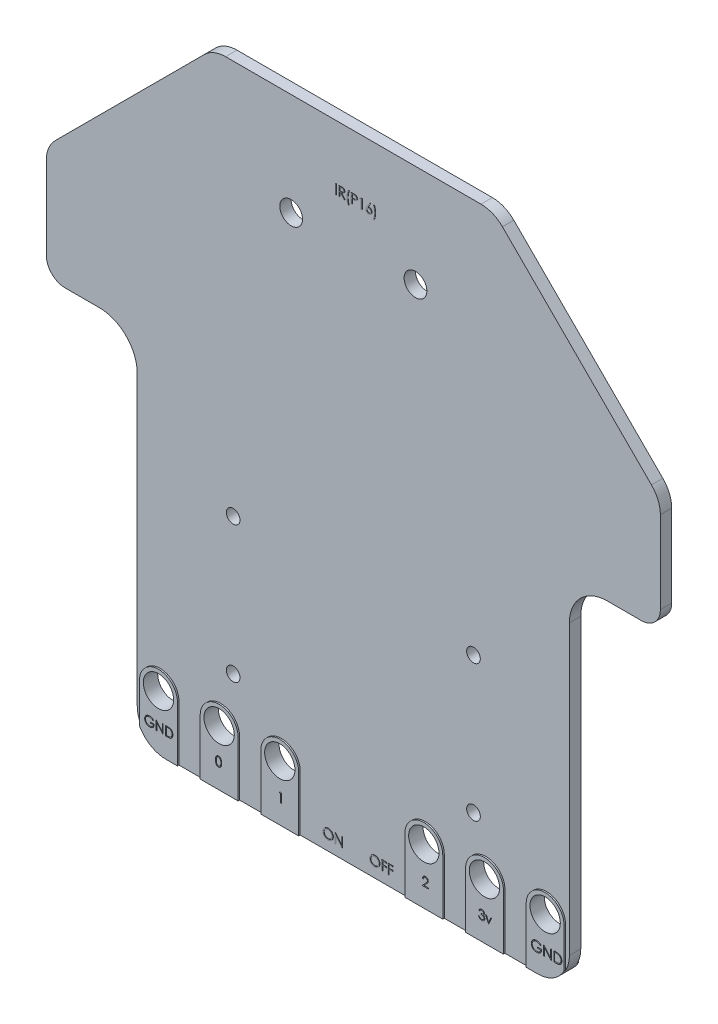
from build123d import *
from build123d.topology import SkipClean

# Parameters (mm, degrees)
ESQUISSE1_R             = 1.5
ESQUISSE1_R_2           = 0.9
ESQUISSE1_R_3           = 2
EXTRUSION1_DEPTH        = 1.5
ESQUISSE2_R             = 2
EXTRUSION2_DEPTH        = 0.2
ENL_V_MAT_EXTRU_1_DEPTH = 0.2
ESQUISSE4_W             = 0.112179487
ESQUISSE4_H             = 1.25
EXTRUSION3_DEPTH        = 0.05


with BuildPart() as part:
    # Esquisse1 → Extrusion1 (new body)
    with BuildSketch(Plane.XY):
        with BuildLine():
            Line((20.508625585, 0), (69.508625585, 0))
            ThreePointArc((69.508625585, 0), (72.337052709, 1.171572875), (73.508625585, 4))
            Line((73.508625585, 4), (73.508625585, 42))
            ThreePointArc((73.508625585, 42), (74.973091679, 45.535533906), (78.508625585, 47))
            Line((78.508625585, 47), (83.008625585, 47))
            ThreePointArc((83.008625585, 47), (84.776392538, 47.732233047), (85.508625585, 49.5))
            Line((85.508625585, 49.5), (85.508625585, 60.343145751))
            ThreePointArc((85.508625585, 60.343145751), (85.204143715, 61.87387948), (84.337052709, 63.171572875))
            Line((84.337052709, 63.171572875), (64.68019846, 82.828427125))
            ThreePointArc((64.68019846, 82.828427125), (63.382505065, 83.69551813), (61.851771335, 84))
            Line((61.851771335, 84), (28.165479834, 84))
            ThreePointArc((28.165479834, 84), (26.634746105, 83.69551813), (25.337052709, 82.828427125))
            Line((25.337052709, 82.828427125), (5.68019846, 63.171572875))
            ThreePointArc((5.68019846, 63.171572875), (4.813107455, 61.87387948), (4.508625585, 60.343145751))
            Line((4.508625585, 60.343145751), (4.508625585, 49.5))
            ThreePointArc((4.508625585, 49.5), (5.240858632, 47.732233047), (7.008625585, 47))
            Line((7.008625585, 47), (11.508625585, 47))
            ThreePointArc((11.508625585, 47), (15.04415949, 45.535533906), (16.508625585, 42))
            Line((16.508625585, 42), (16.508625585, 4))
            ThreePointArc((16.508625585, 4), (17.68019846, 1.171572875), (20.508625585, 0))
        make_face()
        with Locations((53.208625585, 70.5)):
            Circle(ESQUISSE1_R, mode=Mode.SUBTRACT)
        with Locations(Location((36.808625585, 70.5, 0), (0, 0, 180))):
            Circle(ESQUISSE1_R, mode=Mode.SUBTRACT)
        with Locations((60.858625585, 14)):
            Circle(ESQUISSE1_R_2, mode=Mode.SUBTRACT)
        with Locations(Location((60.858625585, 32, 0), (0, 0, 180))):
            Circle(ESQUISSE1_R_2, mode=Mode.SUBTRACT)
        with Locations(Location((29.158625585, 14, 0), (0, 0, 180))):
            Circle(ESQUISSE1_R_2, mode=Mode.SUBTRACT)
        with Locations((29.158625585, 32)):
            Circle(ESQUISSE1_R_2, mode=Mode.SUBTRACT)
        with Locations((19.508625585, 7.3)):
            Circle(ESQUISSE1_R_3, mode=Mode.SUBTRACT)
        with Locations((27.508625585, 7.3)):
            Circle(ESQUISSE1_R_3, mode=Mode.SUBTRACT)
        with Locations((35.508625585, 7.3)):
            Circle(ESQUISSE1_R_3, mode=Mode.SUBTRACT)
        with Locations((70.508625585, 7.3)):
            Circle(ESQUISSE1_R_3, mode=Mode.SUBTRACT)
        with Locations((62.508625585, 7.3)):
            Circle(ESQUISSE1_R_3, mode=Mode.SUBTRACT)
        with Locations((54.508625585, 7.3)):
            Circle(ESQUISSE1_R_3, mode=Mode.SUBTRACT)
    extrude(amount=EXTRUSION1_DEPTH)

    # Esquisse2 → Extrusion2 (add)
    # profile 1 of 6: a face of its own
    with BuildSketch(Plane.XY.offset(1.5)):
        with BuildLine():
            Line((22.008625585, 7.3), (22.008625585, 0))
            Line((22.008625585, 0), (20.508625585, 0))
            ThreePointArc((20.508625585, 0), (18.477119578, 0.554280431), (17.008625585, 2.063508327))
            Line((17.008625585, 2.063508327), (17.008625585, 7.3))
            ThreePointArc((17.008625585, 7.3), (19.508625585, 9.8), (22.008625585, 7.3))
        make_face()
        with Locations((19.508625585, 7.3)):
            Circle(ESQUISSE2_R, mode=Mode.SUBTRACT)
    # profile 2 of 6: a face of its own
    with BuildSketch(Plane.XY.offset(1.5)):
        with BuildLine():
            Line((25.008625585, 7.3), (25.008625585, 0))
            Line((25.008625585, 0), (30.008625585, 0))
            Line((30.008625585, 0), (30.008625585, 7.3))
            ThreePointArc((30.008625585, 7.3), (27.508625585, 9.8), (25.008625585, 7.3))
        make_face()
        with Locations((27.508625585, 7.3)):
            Circle(ESQUISSE2_R, mode=Mode.SUBTRACT)
    # profile 3 of 6: a face of its own
    with BuildSketch(Plane.XY.offset(1.5)):
        with BuildLine():
            Line((33.008625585, 7.3), (33.008625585, 0))
            Line((33.008625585, 0), (38.008625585, 0))
            Line((38.008625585, 0), (38.008625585, 7.3))
            ThreePointArc((38.008625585, 7.3), (35.508625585, 9.8), (33.008625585, 7.3))
        make_face()
        with Locations((35.508625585, 7.3)):
            Circle(ESQUISSE2_R, mode=Mode.SUBTRACT)
    # profile 4 of 6: a face of its own
    with BuildSketch(Plane.XY.offset(1.5)):
        with BuildLine():
            Line((52.008625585, 0), (52.008625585, 7.3))
            ThreePointArc((52.008625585, 7.3), (54.508625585, 9.8), (57.008625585, 7.3))
            Line((57.008625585, 7.3), (57.008625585, 0))
            Line((57.008625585, 0), (52.008625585, 0))
        make_face()
        with Locations(Location((54.508625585, 7.3, 0), (0, 0, 180))):
            Circle(ESQUISSE2_R, mode=Mode.SUBTRACT)
    # profile 5 of 6: a face of its own
    with BuildSketch(Plane.XY.offset(1.5)):
        with BuildLine():
            Line((60.008625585, 0), (60.008625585, 7.3))
            ThreePointArc((60.008625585, 7.3), (62.508625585, 9.8), (65.008625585, 7.3))
            Line((65.008625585, 7.3), (65.008625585, 0))
            Line((65.008625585, 0), (60.008625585, 0))
        make_face()
        with Locations(Location((62.508625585, 7.3, 0), (0, 0, 180))):
            Circle(ESQUISSE2_R, mode=Mode.SUBTRACT)
    # profile 6 of 6: a face of its own
    with BuildSketch(Plane.XY.offset(1.5)):
        with BuildLine():
            Line((68.008625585, 0), (69.508625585, 0))
            ThreePointArc((69.508625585, 0), (71.540131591, 0.554280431), (73.008625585, 2.063508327))
            Line((73.008625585, 2.063508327), (73.008625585, 7.3))
            ThreePointArc((73.008625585, 7.3), (70.508625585, 9.8), (68.008625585, 7.3))
            Line((68.008625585, 7.3), (68.008625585, 0))
        make_face()
        with Locations(Location((70.508625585, 7.3, 0), (0, 0, 180))):
            Circle(ESQUISSE2_R, mode=Mode.SUBTRACT)
    extrusion2 = extrude(amount=EXTRUSION2_DEPTH)

    # Esquisse3 → Enl_v. mat.-Extru.1 (cut)
    # profile 1 of 11: a face of its own
    with BuildSketch(Plane.XY.offset(1.7)):
        with BuildLine():
            Line((18.874225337, 3.651547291), (18.781917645, 3.564047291))
            add(Edge.make_bspline(
                [(18.781917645, 3.564047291), (18.765214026, 3.57976073), (18.732205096, 3.610812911), (18.678390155, 3.651102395), (18.622242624, 3.685616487), (18.564055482, 3.713698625), (18.505269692, 3.736105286), (18.44666554, 3.752057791), (18.388844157, 3.762231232), (18.350386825, 3.763447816), (18.331436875, 3.764047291)],
                knots=[0, 0, 0, 0, 1.08915593, 2.152340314, 3.188132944, 4.216796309, 5.218260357, 6.173443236, 7.099959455, 8, 8, 8, 8], degree=3))
            add(Edge.make_bspline(
                [(18.331436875, 3.764047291), (18.319808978, 3.763905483), (18.296583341, 3.763622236), (18.262084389, 3.760007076), (18.227947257, 3.754807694), (18.194236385, 3.747284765), (18.16088623, 3.73775023), (18.128012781, 3.725823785), (18.095554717, 3.71191913), (18.063817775, 3.695851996), (18.033049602, 3.678201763), (18.003990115, 3.658642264), (17.976454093, 3.637800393), (17.95095909, 3.615154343), (17.927358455, 3.590909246), (17.905090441, 3.565516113), (17.884938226, 3.53828118), (17.86673554, 3.509705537), (17.850497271, 3.480291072), (17.836162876, 3.450320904), (17.824129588, 3.41989444), (17.814608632, 3.388973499), (17.806753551, 3.357797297), (17.801227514, 3.326149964), (17.798112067, 3.293997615), (17.797573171, 3.272467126), (17.79730226, 3.261643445)],
                knots=[0, 0, 0, 0, 1.02818874, 2.053710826, 3.065248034, 4.081641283, 5.106893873, 6.131558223, 7.173050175, 8.228653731, 9.27666206, 10.308777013, 11.325269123, 12.329503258, 13.32196095, 14.316845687, 15.314881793, 16.315733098, 17.311955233, 18.285320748, 19.252783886, 20.203351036, 21.145449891, 22.095197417, 23.042428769, 24, 24, 24, 24], degree=3))
            add(Edge.make_bspline(
                [(17.79730226, 3.261643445), (17.797561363, 3.250579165), (17.798078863, 3.228480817), (17.801390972, 3.195499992), (17.807537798, 3.163008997), (17.815755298, 3.130901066), (17.826034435, 3.099121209), (17.83884792, 3.067807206), (17.854024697, 3.036960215), (17.871591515, 3.006858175), (17.890855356, 2.977535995), (17.912435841, 2.949915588), (17.93535947, 2.92362915), (17.960461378, 2.899260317), (17.98693665, 2.876157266), (18.015576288, 2.854956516), (18.045817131, 2.835249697), (18.077705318, 2.817285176), (18.110894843, 2.801236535), (18.14492573, 2.786965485), (18.179906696, 2.775212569), (18.215653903, 2.765633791), (18.252124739, 2.75778226), (18.289504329, 2.752731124), (18.327517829, 2.749065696), (18.353142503, 2.748797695), (18.36605226, 2.748662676)],
                knots=[0, 0, 0, 0, 0.93586088, 1.869166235, 2.799637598, 3.729985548, 4.670839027, 5.622275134, 6.589130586, 7.576015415, 8.568469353, 9.55398029, 10.53834874, 11.515998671, 12.510579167, 13.508179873, 14.527009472, 15.561807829, 16.601455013, 17.643573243, 18.680854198, 19.719860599, 20.772568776, 21.833555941, 22.908541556, 24, 24, 24, 24], degree=3))
            add(Edge.make_bspline(
                [(18.36605226, 2.748662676), (18.38161055, 2.748987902), (18.412161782, 2.749626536), (18.457071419, 2.754598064), (18.5002039, 2.762362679), (18.541438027, 2.773733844), (18.580821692, 2.788237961), (18.618499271, 2.805722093), (18.654174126, 2.826856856), (18.6879535, 2.850710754), (18.719070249, 2.877287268), (18.74713452, 2.905965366), (18.771698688, 2.936605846), (18.79312887, 2.96902824), (18.810857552, 3.003500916), (18.825409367, 3.039854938), (18.836563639, 3.078106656), (18.841142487, 3.104538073), (18.843456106, 3.117893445)],
                knots=[0, 0, 0, 0, 1.13008108, 2.219097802, 3.278683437, 4.311054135, 5.322181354, 6.324827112, 7.324222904, 8.330512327, 9.32562643, 10.293043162, 11.24128371, 12.174520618, 13.111833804, 14.052305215, 15.015860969, 16, 16, 16, 16], degree=3))
            Line((18.843456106, 3.117893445), (18.443456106, 3.117893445))
            Line((18.443456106, 3.117893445), (18.443456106, 3.240970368))
            Line((18.443456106, 3.240970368), (18.951148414, 3.240970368))
            add(Edge.make_bspline(
                [(18.951148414, 3.240970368), (18.950563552, 3.218030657), (18.94941887, 3.1731335), (18.941389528, 3.107657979), (18.928423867, 3.045816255), (18.91071176, 2.987543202), (18.887783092, 2.932921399), (18.859883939, 2.881895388), (18.826567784, 2.834794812), (18.789021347, 2.791235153), (18.746884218, 2.752379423), (18.701294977, 2.718228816), (18.652178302, 2.689462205), (18.599580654, 2.666058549), (18.54367422, 2.64779318), (18.484329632, 2.634842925), (18.421627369, 2.62708408), (18.378654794, 2.62609275), (18.35667726, 2.625585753)],
                knots=[0, 0, 0, 0, 1.140356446, 2.231883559, 3.274166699, 4.278491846, 5.25512956, 6.21435461, 7.1637429, 8.11826594, 9.068280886, 10.0076534, 10.945064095, 11.891975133, 12.864533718, 13.863980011, 14.907571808, 16, 16, 16, 16], degree=3))
            add(Edge.make_bspline(
                [(18.35667726, 2.625585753), (18.343130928, 2.62578088), (18.316413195, 2.626165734), (18.276953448, 2.628900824), (18.238581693, 2.633111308), (18.201303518, 2.639469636), (18.164981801, 2.647257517), (18.129797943, 2.657230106), (18.095617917, 2.66877366), (18.062388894, 2.681903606), (18.030412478, 2.697116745), (17.999546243, 2.714022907), (17.969619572, 2.732534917), (17.940836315, 2.752972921), (17.913046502, 2.77518405), (17.886429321, 2.799212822), (17.860835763, 2.824985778), (17.844803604, 2.843287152), (17.836725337, 2.852508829)],
                knots=[0, 0, 0, 0, 1.107784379, 2.184907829, 3.233506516, 4.263428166, 5.276301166, 6.270063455, 7.25232949, 8.225834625, 9.190232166, 10.146266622, 11.1027726, 12.066435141, 13.031522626, 14.010570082, 14.99756817, 16, 16, 16, 16], degree=3))
            add(Edge.make_bspline(
                [(17.836725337, 2.852508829), (17.825004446, 2.867138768), (17.801757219, 2.896155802), (17.771833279, 2.942647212), (17.746324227, 2.990784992), (17.725626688, 3.040703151), (17.709465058, 3.092354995), (17.697874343, 3.145674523), (17.691083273, 3.200730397), (17.690104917, 3.237987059), (17.689609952, 3.256835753)],
                knots=[0, 0, 0, 0, 1.023165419, 2.029347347, 3.013907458, 3.994755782, 4.975994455, 5.96558838, 6.970761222, 8, 8, 8, 8], degree=3))
            add(Edge.make_bspline(
                [(17.689609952, 3.256835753), (17.689792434, 3.270949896), (17.690155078, 3.298998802), (17.694552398, 3.340641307), (17.700861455, 3.381544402), (17.710134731, 3.421674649), (17.721824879, 3.461058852), (17.736414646, 3.499715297), (17.753401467, 3.537666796), (17.773145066, 3.574652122), (17.795116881, 3.610180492), (17.818962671, 3.644108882), (17.845021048, 3.675819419), (17.872866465, 3.705713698), (17.902831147, 3.73341616), (17.934634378, 3.759183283), (17.968300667, 3.783049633), (18.003935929, 3.80463929), (18.041008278, 3.824032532), (18.07942885, 3.841034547), (18.119185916, 3.85508597), (18.159981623, 3.867008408), (18.202124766, 3.875825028), (18.245309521, 3.882218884), (18.289760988, 3.886593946), (18.319807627, 3.886945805), (18.335042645, 3.887124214)],
                knots=[0, 0, 0, 0, 1.008945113, 2.00506715, 2.99143336, 3.967273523, 4.948097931, 5.927297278, 6.919902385, 7.919676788, 8.923139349, 9.905703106, 10.883022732, 11.856032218, 12.825136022, 13.798837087, 14.781400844, 15.773989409, 16.776158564, 17.77167057, 18.775803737, 19.789618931, 20.80898985, 21.851988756, 22.910860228, 24, 24, 24, 24], degree=3))
            add(Edge.make_bspline(
                [(18.335042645, 3.887124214), (18.347467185, 3.886925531), (18.372103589, 3.886531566), (18.408763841, 3.88380083), (18.444857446, 3.879472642), (18.480437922, 3.873566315), (18.515384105, 3.865521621), (18.549795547, 3.855894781), (18.58372213, 3.844686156), (18.61705753, 3.831318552), (18.65002589, 3.81614588), (18.682810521, 3.799066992), (18.715299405, 3.779789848), (18.747548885, 3.758257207), (18.779762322, 3.734838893), (18.811430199, 3.708865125), (18.843316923, 3.68136018), (18.863820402, 3.661583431), (18.874225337, 3.651547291)],
                knots=[0, 0, 0, 0, 0.985871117, 1.954866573, 2.915460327, 3.869826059, 4.81536089, 5.759505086, 6.70452669, 7.649098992, 8.607881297, 9.583363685, 10.581137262, 11.603961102, 12.659522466, 13.73993555, 14.853081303, 16, 16, 16, 16], degree=3))
        make_face()
    # profile 2 of 11: a face of its own
    with BuildSketch(Plane.XY.offset(1.7)):
        Polygon((19.19730226, 2.656354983), (19.19730226, 3.856354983), (19.219898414, 3.856354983), (20.012686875, 2.911883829), (20.012686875, 3.856354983), (20.120379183, 3.856354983), (20.120379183, 2.656354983), (20.095859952, 2.656354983), (19.304994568, 3.598662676), (19.304994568, 2.656354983), align=None)
    # profile 3 of 11: a face of its own
    with BuildSketch(Plane.XY.offset(1.7)):
        with BuildLine():
            Line((20.428071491, 2.656354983), (20.428071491, 3.856354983))
            Line((20.428071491, 3.856354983), (20.670379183, 3.856354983))
            add(Edge.make_bspline(
                [(20.670379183, 3.856354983), (20.691454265, 3.856203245), (20.732171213, 3.855910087), (20.791009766, 3.854051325), (20.845449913, 3.850763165), (20.895312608, 3.845973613), (20.940734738, 3.840092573), (20.981589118, 3.832721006), (21.018086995, 3.82401649), (21.040533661, 3.816595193), (21.051148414, 3.813085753)],
                knots=[0, 0, 0, 0, 1.314313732, 2.53924729, 3.670748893, 4.714932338, 5.66265055, 6.526160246, 7.303039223, 8, 8, 8, 8], degree=3))
            add(Edge.make_bspline(
                [(21.051148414, 3.813085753), (21.065032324, 3.807795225), (21.092485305, 3.797334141), (21.131573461, 3.777600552), (21.168370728, 3.755241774), (21.203074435, 3.730228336), (21.234891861, 3.701851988), (21.265065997, 3.67131813), (21.292362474, 3.637516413), (21.317359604, 3.601147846), (21.339897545, 3.562640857), (21.359488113, 3.522068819), (21.375758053, 3.479637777), (21.389264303, 3.435465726), (21.399908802, 3.389455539), (21.407171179, 3.341553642), (21.411961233, 3.291949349), (21.412442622, 3.258289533), (21.412686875, 3.241210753)],
                knots=[0, 0, 0, 0, 0.984719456, 1.947108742, 2.898477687, 3.838006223, 4.779231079, 5.722358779, 6.681677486, 7.655904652, 8.64651281, 9.637519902, 10.640069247, 11.656948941, 12.698408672, 13.768548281, 14.867775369, 16, 16, 16, 16], degree=3))
            add(Edge.make_bspline(
                [(21.412686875, 3.241210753), (21.412471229, 3.226378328), (21.412046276, 3.197149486), (21.408230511, 3.154072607), (21.402684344, 3.112273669), (21.394097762, 3.071951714), (21.383674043, 3.032753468), (21.370314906, 2.995096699), (21.355011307, 2.958635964), (21.337165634, 2.923864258), (21.317574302, 2.890921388), (21.296549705, 2.859866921), (21.274114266, 2.831143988), (21.250054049, 2.804665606), (21.224679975, 2.780471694), (21.197825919, 2.758360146), (21.169422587, 2.738763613), (21.139597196, 2.720912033), (21.107479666, 2.705339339), (21.072461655, 2.692163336), (21.034393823, 2.681244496), (20.993369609, 2.672134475), (20.949318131, 2.664907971), (20.9021962, 2.660064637), (20.852076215, 2.656789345), (20.817660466, 2.656502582), (20.799946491, 2.656354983)],
                knots=[0, 0, 0, 0, 1.105936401, 2.179363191, 3.223086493, 4.248585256, 5.251745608, 6.245858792, 7.225916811, 8.198733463, 9.158002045, 10.082870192, 10.993790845, 11.873723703, 12.748670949, 13.606408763, 14.465103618, 15.319838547, 16.196477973, 17.123216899, 18.106603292, 19.147568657, 20.255746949, 21.433717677, 22.679120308, 24, 24, 24, 24], degree=3))
            Line((20.799946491, 2.656354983), (20.428071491, 2.656354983))
        make_face()
        with BuildLine():
            Line((20.535763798, 2.779431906), (20.673504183, 2.779431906))
            add(Edge.make_bspline(
                [(20.673504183, 2.779431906), (20.693296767, 2.779516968), (20.731365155, 2.779680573), (20.78610504, 2.781116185), (20.836120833, 2.783461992), (20.881419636, 2.786744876), (20.921975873, 2.791088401), (20.957874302, 2.795931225), (20.988997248, 2.801964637), (21.007830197, 2.807433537), (21.016533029, 2.809960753)],
                knots=[0, 0, 0, 0, 1.375205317, 2.645023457, 3.804390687, 4.853969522, 5.800190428, 6.637939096, 7.370582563, 8, 8, 8, 8], degree=3))
            add(Edge.make_bspline(
                [(21.016533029, 2.809960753), (21.027486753, 2.81381843), (21.049132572, 2.821441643), (21.080291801, 2.835347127), (21.109351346, 2.851818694), (21.13681764, 2.870128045), (21.162301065, 2.89092096), (21.186103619, 2.913745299), (21.20817738, 2.938717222), (21.228294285, 2.965805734), (21.246297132, 2.994842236), (21.261887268, 3.025541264), (21.27555065, 3.057566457), (21.286274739, 3.091409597), (21.294680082, 3.126768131), (21.30063369, 3.163644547), (21.304341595, 3.202031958), (21.304774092, 3.228141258), (21.304994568, 3.241451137)],
                knots=[0, 0, 0, 0, 0.998632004, 1.973411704, 2.929992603, 3.868527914, 4.809262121, 5.754881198, 6.702106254, 7.672490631, 8.653608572, 9.636854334, 10.631411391, 11.644891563, 12.686317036, 13.754757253, 14.855430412, 16, 16, 16, 16], degree=3))
            add(Edge.make_bspline(
                [(21.304994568, 3.241451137), (21.304818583, 3.255485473), (21.304472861, 3.283056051), (21.300127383, 3.323510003), (21.293777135, 3.362417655), (21.284594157, 3.399781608), (21.272892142, 3.435674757), (21.258288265, 3.469898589), (21.241602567, 3.502814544), (21.221749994, 3.533662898), (21.200007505, 3.562837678), (21.175877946, 3.589565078), (21.149744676, 3.613905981), (21.121892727, 3.63623946), (21.09153715, 3.655667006), (21.059393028, 3.673045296), (21.024988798, 3.687793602), (21.001053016, 3.695637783), (20.988888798, 3.699624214)],
                knots=[0, 0, 0, 0, 1.122418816, 2.205001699, 3.251619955, 4.274784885, 5.280384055, 6.268708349, 7.249350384, 8.229342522, 9.199999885, 10.157847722, 11.105861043, 12.055065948, 13.010012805, 13.98527497, 14.976112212, 16, 16, 16, 16], degree=3))
            add(Edge.make_bspline(
                [(20.988888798, 3.699624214), (20.978825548, 3.702406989), (20.957428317, 3.708323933), (20.92251193, 3.714778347), (20.883215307, 3.720471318), (20.839363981, 3.725291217), (20.791007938, 3.728749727), (20.738109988, 3.731345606), (20.680647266, 3.733096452), (20.640813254, 3.733216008), (20.620138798, 3.73327806)],
                knots=[0, 0, 0, 0, 0.674548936, 1.434276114, 2.292660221, 3.240891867, 4.284742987, 5.42552168, 6.663806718, 8, 8, 8, 8], degree=3))
            Line((20.620138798, 3.73327806), (20.535763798, 3.73327806))
            Line((20.535763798, 3.73327806), (20.535763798, 2.779431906))
        make_face(mode=Mode.SUBTRACT)
    # profile 4 of 11: a face of its own
    with BuildSketch(Plane.XY.offset(1.7)):
        with BuildLine():
            Line((69.968335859, 3.509680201), (69.868335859, 3.414888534))
            add(Edge.make_bspline(
                [(69.868335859, 3.414888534), (69.850240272, 3.431911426), (69.814480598, 3.46555129), (69.756181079, 3.509198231), (69.695354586, 3.546588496), (69.632318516, 3.577010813), (69.56863391, 3.601284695), (69.505146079, 3.618566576), (69.442506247, 3.629587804), (69.400844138, 3.63090577), (69.380315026, 3.631555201)],
                knots=[0, 0, 0, 0, 1.08915593, 2.152340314, 3.188132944, 4.216796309, 5.218260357, 6.173443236, 7.099959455, 8, 8, 8, 8], degree=3))
            add(Edge.make_bspline(
                [(69.380315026, 3.631555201), (69.367718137, 3.631401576), (69.342557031, 3.631094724), (69.305183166, 3.627178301), (69.268201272, 3.621545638), (69.231681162, 3.613395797), (69.195551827, 3.603066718), (69.159938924, 3.590146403), (69.124776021, 3.575083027), (69.090394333, 3.557676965), (69.057062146, 3.538555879), (69.025581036, 3.517366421), (68.995750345, 3.494787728), (68.968130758, 3.470254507), (68.942563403, 3.443988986), (68.918439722, 3.416479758), (68.896608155, 3.386975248), (68.87688858, 3.356018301), (68.859297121, 3.324152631), (68.843768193, 3.291684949), (68.830732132, 3.258722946), (68.820417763, 3.22522526), (68.811908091, 3.191451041), (68.805921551, 3.15716643), (68.802546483, 3.122334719), (68.801962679, 3.099010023), (68.801669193, 3.087284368)],
                knots=[0, 0, 0, 0, 1.02818874, 2.053710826, 3.065248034, 4.081641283, 5.106893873, 6.131558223, 7.173050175, 8.228653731, 9.27666206, 10.308777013, 11.325269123, 12.329503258, 13.32196095, 14.316845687, 15.314881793, 16.315733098, 17.311955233, 18.285320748, 19.252783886, 20.203351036, 21.145449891, 22.095197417, 23.042428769, 24, 24, 24, 24], degree=3))
            add(Edge.make_bspline(
                [(68.801669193, 3.087284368), (68.801949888, 3.075298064), (68.802510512, 3.051358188), (68.806098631, 3.015628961), (68.812757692, 2.980430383), (68.821659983, 2.94564679), (68.832795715, 2.911218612), (68.846676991, 2.877295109), (68.8631185, 2.843877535), (68.882149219, 2.811266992), (68.90301838, 2.779501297), (68.926397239, 2.749579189), (68.95123117, 2.721102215), (68.978424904, 2.694702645), (69.007106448, 2.669674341), (69.038132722, 2.646706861), (69.070893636, 2.625357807), (69.105439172, 2.605896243), (69.141394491, 2.588510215), (69.178261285, 2.573049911), (69.216157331, 2.560317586), (69.254883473, 2.549940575), (69.294393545, 2.541434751), (69.334888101, 2.535962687), (69.376069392, 2.531991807), (69.403829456, 2.531701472), (69.417815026, 2.531555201)],
                knots=[0, 0, 0, 0, 0.93586088, 1.869166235, 2.799637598, 3.729985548, 4.670839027, 5.622275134, 6.589130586, 7.576015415, 8.568469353, 9.55398029, 10.53834874, 11.515998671, 12.510579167, 13.508179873, 14.527009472, 15.561807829, 16.601455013, 17.643573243, 18.680854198, 19.719860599, 20.772568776, 21.833555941, 22.908541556, 24, 24, 24, 24], degree=3))
            add(Edge.make_bspline(
                [(69.417815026, 2.531555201), (69.434669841, 2.531907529), (69.467767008, 2.532599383), (69.516419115, 2.537985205), (69.56314597, 2.546396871), (69.607816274, 2.558715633), (69.65048191, 2.574428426), (69.691299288, 2.59336957), (69.729947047, 2.616265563), (69.766541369, 2.642107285), (69.800251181, 2.670898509), (69.830654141, 2.701966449), (69.857265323, 2.735160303), (69.880481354, 2.770284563), (69.899687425, 2.807629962), (69.915451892, 2.847013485), (69.927535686, 2.888452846), (69.932496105, 2.917086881), (69.935002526, 2.931555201)],
                knots=[0, 0, 0, 0, 1.13008108, 2.219097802, 3.278683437, 4.311054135, 5.322181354, 6.324827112, 7.324222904, 8.330512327, 9.32562643, 10.293043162, 11.24128371, 12.174520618, 13.111833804, 14.052305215, 15.015860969, 16, 16, 16, 16], degree=3))
            Line((69.935002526, 2.931555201), (69.501669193, 2.931555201))
            Line((69.501669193, 2.931555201), (69.501669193, 3.064888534))
            Line((69.501669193, 3.064888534), (70.051669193, 3.064888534))
            add(Edge.make_bspline(
                [(70.051669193, 3.064888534), (70.051035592, 3.040037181), (70.04979552, 2.991398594), (70.041097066, 2.920466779), (70.027050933, 2.853471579), (70.007862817, 2.790342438), (69.983023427, 2.731168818), (69.952799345, 2.675890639), (69.916706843, 2.624865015), (69.876031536, 2.577675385), (69.830382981, 2.535581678), (69.780994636, 2.498585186), (69.727784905, 2.467421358), (69.670804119, 2.442067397), (69.610238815, 2.422279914), (69.545948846, 2.408250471), (69.478021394, 2.399845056), (69.431467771, 2.398771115), (69.407658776, 2.398221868)],
                knots=[0, 0, 0, 0, 1.140356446, 2.231883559, 3.274166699, 4.278491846, 5.25512956, 6.21435461, 7.1637429, 8.11826594, 9.068280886, 10.0076534, 10.945064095, 11.891975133, 12.864533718, 13.863980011, 14.907571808, 16, 16, 16, 16], degree=3))
            add(Edge.make_bspline(
                [(69.407658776, 2.398221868), (69.392983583, 2.398433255), (69.364039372, 2.398850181), (69.321291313, 2.401813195), (69.279721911, 2.406374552), (69.239337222, 2.413262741), (69.199988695, 2.421699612), (69.161872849, 2.432503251), (69.124844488, 2.445008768), (69.088846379, 2.459232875), (69.054205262, 2.475713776), (69.020766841, 2.494028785), (68.98834628, 2.514083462), (68.957164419, 2.536224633), (68.927058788, 2.56028669), (68.898223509, 2.58631786), (68.870497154, 2.614238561), (68.853128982, 2.634065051), (68.844377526, 2.644055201)],
                knots=[0, 0, 0, 0, 1.107784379, 2.184907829, 3.233506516, 4.263428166, 5.276301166, 6.270063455, 7.25232949, 8.225834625, 9.190232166, 10.146266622, 11.1027726, 12.066435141, 13.031522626, 14.010570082, 14.99756817, 16, 16, 16, 16], degree=3))
            add(Edge.make_bspline(
                [(68.844377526, 2.644055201), (68.831679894, 2.659904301), (68.806495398, 2.691339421), (68.774077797, 2.741705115), (68.74644299, 2.793854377), (68.724020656, 2.847932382), (68.706512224, 2.903888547), (68.693955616, 2.961651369), (68.686598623, 3.021295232), (68.685538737, 3.061656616), (68.685002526, 3.082076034)],
                knots=[0, 0, 0, 0, 1.023165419, 2.029347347, 3.013907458, 3.994755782, 4.975994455, 5.96558838, 6.970761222, 8, 8, 8, 8], degree=3))
            add(Edge.make_bspline(
                [(68.685002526, 3.082076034), (68.685200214, 3.097366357), (68.685593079, 3.127752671), (68.690356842, 3.172865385), (68.697191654, 3.217177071), (68.707237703, 3.260651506), (68.71990203, 3.303317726), (68.735707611, 3.345195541), (68.75411, 3.386309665), (68.775498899, 3.426377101), (68.799301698, 3.464866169), (68.825134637, 3.501621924), (68.853364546, 3.535975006), (68.883530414, 3.568360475), (68.915992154, 3.598371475), (68.950445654, 3.626285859), (68.986917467, 3.652141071), (69.025522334, 3.675529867), (69.065684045, 3.696539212), (69.107306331, 3.714958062), (69.150376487, 3.730180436), (69.194571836, 3.743096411), (69.240226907, 3.752647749), (69.287010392, 3.759574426), (69.335166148, 3.764314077), (69.367716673, 3.764695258), (69.384221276, 3.764888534)],
                knots=[0, 0, 0, 0, 1.008945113, 2.00506715, 2.99143336, 3.967273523, 4.948097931, 5.927297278, 6.919902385, 7.919676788, 8.923139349, 9.905703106, 10.883022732, 11.856032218, 12.825136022, 13.798837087, 14.781400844, 15.773989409, 16.776158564, 17.77167057, 18.775803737, 19.789618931, 20.80898985, 21.851988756, 22.910860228, 24, 24, 24, 24], degree=3))
            add(Edge.make_bspline(
                [(69.384221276, 3.764888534), (69.397681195, 3.764673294), (69.424370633, 3.764246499), (69.464085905, 3.761288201), (69.50318731, 3.756599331), (69.541732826, 3.750200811), (69.579591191, 3.741485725), (69.616870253, 3.731056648), (69.653624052, 3.718913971), (69.689737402, 3.7044324), (69.725453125, 3.687995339), (69.760969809, 3.669493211), (69.7961661, 3.648609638), (69.831103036, 3.62528261), (69.866000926, 3.599912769), (69.900307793, 3.571774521), (69.934851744, 3.541977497), (69.957063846, 3.520552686), (69.968335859, 3.509680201)],
                knots=[0, 0, 0, 0, 0.985871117, 1.954866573, 2.915460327, 3.869826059, 4.81536089, 5.759505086, 6.70452669, 7.649098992, 8.607881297, 9.583363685, 10.581137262, 11.603961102, 12.659522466, 13.73993555, 14.853081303, 16, 16, 16, 16], degree=3))
        make_face()
    # profile 5 of 11: a face of its own
    with BuildSketch(Plane.XY.offset(1.7)):
        Polygon((70.318335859, 2.431555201), (70.318335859, 3.731555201), (70.342815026, 3.731555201), (71.201669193, 2.708378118), (71.201669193, 3.731555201), (71.318335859, 3.731555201), (71.318335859, 2.431555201), (71.291773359, 2.431555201), (70.435002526, 3.452388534), (70.435002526, 2.431555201), align=None)
    # profile 6 of 11: a face of its own
    with BuildSketch(Plane.XY.offset(1.7)):
        with BuildLine():
            Line((71.651669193, 2.431555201), (71.651669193, 3.731555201))
            Line((71.651669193, 3.731555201), (71.914169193, 3.731555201))
            add(Edge.make_bspline(
                [(71.914169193, 3.731555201), (71.937000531, 3.731390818), (71.981110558, 3.73107323), (72.044852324, 3.729059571), (72.10382915, 3.725497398), (72.157847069, 3.720308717), (72.207054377, 3.71393759), (72.251313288, 3.705951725), (72.290852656, 3.696521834), (72.315169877, 3.688482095), (72.326669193, 3.684680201)],
                knots=[0, 0, 0, 0, 1.314313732, 2.53924729, 3.670748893, 4.714932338, 5.66265055, 6.526160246, 7.303039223, 8, 8, 8, 8], degree=3))
            add(Edge.make_bspline(
                [(72.326669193, 3.684680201), (72.341710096, 3.678948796), (72.371450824, 3.667615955), (72.413796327, 3.646237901), (72.453660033, 3.622015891), (72.491255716, 3.594917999), (72.525724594, 3.564176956), (72.558413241, 3.53109861), (72.587984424, 3.494480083), (72.615064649, 3.455080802), (72.639480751, 3.413364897), (72.660703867, 3.369411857), (72.678329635, 3.323444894), (72.692961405, 3.275591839), (72.704492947, 3.22574747), (72.712360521, 3.173853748), (72.717549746, 3.120115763), (72.718071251, 3.083650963), (72.718335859, 3.065148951)],
                knots=[0, 0, 0, 0, 0.984719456, 1.947108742, 2.898477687, 3.838006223, 4.779231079, 5.722358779, 6.681677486, 7.655904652, 8.64651281, 9.637519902, 10.640069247, 11.656948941, 12.698408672, 13.768548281, 14.867775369, 16, 16, 16, 16], degree=3))
            add(Edge.make_bspline(
                [(72.718335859, 3.065148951), (72.718102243, 3.049080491), (72.717641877, 3.017415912), (72.713508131, 2.970749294), (72.707499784, 2.92546711), (72.698197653, 2.881784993), (72.686905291, 2.839320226), (72.672432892, 2.798525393), (72.655853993, 2.759026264), (72.636521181, 2.721356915), (72.615297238, 2.685668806), (72.592520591, 2.652026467), (72.568215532, 2.620909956), (72.542150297, 2.592225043), (72.514661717, 2.566014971), (72.485569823, 2.542060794), (72.454799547, 2.520831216), (72.422488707, 2.501492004), (72.387694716, 2.484621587), (72.349758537, 2.470347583), (72.308518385, 2.45851884), (72.264075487, 2.44864965), (72.216353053, 2.440820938), (72.165304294, 2.435573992), (72.111007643, 2.43202576), (72.073723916, 2.4317151), (72.054533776, 2.431555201)],
                knots=[0, 0, 0, 0, 1.105936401, 2.179363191, 3.223086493, 4.248585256, 5.251745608, 6.245858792, 7.225916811, 8.198733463, 9.158002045, 10.082870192, 10.993790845, 11.873723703, 12.748670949, 13.606408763, 14.465103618, 15.319838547, 16.196477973, 17.123216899, 18.106603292, 19.147568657, 20.255746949, 21.433717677, 22.679120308, 24, 24, 24, 24], degree=3))
            Line((72.054533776, 2.431555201), (71.651669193, 2.431555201))
        make_face()
        with BuildLine():
            Line((71.768335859, 2.564888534), (71.917554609, 2.564888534))
            add(Edge.make_bspline(
                [(71.917554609, 2.564888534), (71.938996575, 2.564980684), (71.980237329, 2.565157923), (72.039538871, 2.56671317), (72.093722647, 2.569254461), (72.14279635, 2.572810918), (72.186732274, 2.577516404), (72.225622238, 2.582762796), (72.259338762, 2.589298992), (72.279741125, 2.595223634), (72.289169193, 2.597961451)],
                knots=[0, 0, 0, 0, 1.375205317, 2.645023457, 3.804390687, 4.853969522, 5.800190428, 6.637939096, 7.370582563, 8, 8, 8, 8], degree=3))
            add(Edge.make_bspline(
                [(72.289169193, 2.597961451), (72.301035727, 2.602140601), (72.324485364, 2.610399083), (72.358241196, 2.625463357), (72.389722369, 2.643307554), (72.419477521, 2.663142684), (72.447084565, 2.685668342), (72.472870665, 2.71039471), (72.496783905, 2.737447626), (72.51857722, 2.766793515), (72.538080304, 2.798249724), (72.554969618, 2.831507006), (72.569771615, 2.866200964), (72.581389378, 2.902864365), (72.590495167, 2.941169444), (72.596944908, 2.981118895), (72.600961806, 3.022705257), (72.601430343, 3.050990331), (72.601669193, 3.065409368)],
                knots=[0, 0, 0, 0, 0.998632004, 1.973411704, 2.929992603, 3.868527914, 4.809262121, 5.754881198, 6.702106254, 7.672490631, 8.653608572, 9.636854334, 10.631411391, 11.644891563, 12.686317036, 13.754757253, 14.855430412, 16, 16, 16, 16], degree=3))
            add(Edge.make_bspline(
                [(72.601669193, 3.065409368), (72.601478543, 3.080613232), (72.60110401, 3.110481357), (72.596396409, 3.154306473), (72.589516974, 3.196456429), (72.579568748, 3.236934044), (72.566891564, 3.275818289), (72.551070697, 3.312894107), (72.532994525, 3.348553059), (72.511487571, 3.381972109), (72.487933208, 3.413578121), (72.461792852, 3.442532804), (72.43348181, 3.468902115), (72.403308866, 3.493096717), (72.370423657, 3.514143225), (72.335600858, 3.532969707), (72.298329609, 3.548947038), (72.272399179, 3.557444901), (72.259221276, 3.561763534)],
                knots=[0, 0, 0, 0, 1.122418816, 2.205001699, 3.251619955, 4.274784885, 5.280384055, 6.268708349, 7.249350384, 8.229342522, 9.199999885, 10.157847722, 11.105861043, 12.055065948, 13.010012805, 13.98527497, 14.976112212, 16, 16, 16, 16], degree=3))
            add(Edge.make_bspline(
                [(72.259221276, 3.561763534), (72.248319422, 3.564778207), (72.225139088, 3.57118823), (72.187313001, 3.578180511), (72.14474166, 3.584347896), (72.097236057, 3.589569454), (72.044850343, 3.593316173), (71.987544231, 3.596128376), (71.925292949, 3.598025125), (71.882139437, 3.598154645), (71.859742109, 3.598221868)],
                knots=[0, 0, 0, 0, 0.674548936, 1.434276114, 2.292660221, 3.240891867, 4.284742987, 5.42552168, 6.663806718, 8, 8, 8, 8], degree=3))
            Line((71.859742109, 3.598221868), (71.768335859, 3.598221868))
            Line((71.768335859, 3.598221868), (71.768335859, 2.564888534))
        make_face(mode=Mode.SUBTRACT)
    # profile 7 of 11: a face of its own
    with BuildSketch(Plane.XY.offset(1.7)):
        Polygon((35.512028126, 3.778698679), (35.733903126, 3.778698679), (35.733903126, 2.578698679), (35.626210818, 2.578698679), (35.626210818, 3.655621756), (35.441595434, 3.655621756), align=None)
    # profile 8 of 11: a face of its own
    with BuildSketch(Plane.XY.offset(1.7)):
        with BuildLine():
            add(Edge.make_bspline(
                [(27.02940315, 3.214492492), (27.029515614, 3.233725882), (27.029734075, 3.271087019), (27.032164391, 3.325527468), (27.036201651, 3.376599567), (27.041734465, 3.424305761), (27.048467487, 3.468658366), (27.057455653, 3.509538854), (27.067677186, 3.547136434), (27.079523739, 3.581573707), (27.092890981, 3.613314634), (27.10743987, 3.642946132), (27.123747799, 3.670423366), (27.140882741, 3.696184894), (27.159538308, 3.719809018), (27.179183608, 3.741629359), (27.200585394, 3.761141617), (27.22301614, 3.778917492), (27.246678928, 3.794500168), (27.27089927, 3.808225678), (27.295843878, 3.819951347), (27.321580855, 3.829170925), (27.347878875, 3.836786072), (27.374829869, 3.841993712), (27.402478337, 3.845270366), (27.421140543, 3.845583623), (27.430605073, 3.845742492)],
                knots=[0, 0, 0, 0, 1.646270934, 3.197905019, 4.663502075, 6.030701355, 7.308322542, 8.50163776, 9.611534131, 10.641858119, 11.616356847, 12.558055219, 13.465016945, 14.349605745, 15.204443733, 16.039544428, 16.859896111, 17.680448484, 18.487036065, 19.28249412, 20.06191084, 20.843045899, 21.620316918, 22.403196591, 23.190181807, 24, 24, 24, 24], degree=3))
            add(Edge.make_bspline(
                [(27.430605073, 3.845742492), (27.440148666, 3.845575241), (27.459127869, 3.845242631), (27.487187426, 3.842045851), (27.514598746, 3.836741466), (27.541244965, 3.829225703), (27.56734496, 3.819901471), (27.592694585, 3.80821446), (27.617451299, 3.794610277), (27.641221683, 3.778624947), (27.664266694, 3.760802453), (27.686020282, 3.740655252), (27.706484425, 3.718386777), (27.725915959, 3.694235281), (27.743763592, 3.667737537), (27.760760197, 3.639354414), (27.775973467, 3.608589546), (27.790625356, 3.575956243), (27.803272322, 3.54055156), (27.814677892, 3.50257507), (27.823893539, 3.461578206), (27.831569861, 3.417776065), (27.837516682, 3.371007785), (27.841847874, 3.32137362), (27.844135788, 3.268840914), (27.844566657, 3.232923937), (27.844787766, 3.214492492)],
                knots=[0, 0, 0, 0, 0.810914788, 1.612654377, 2.396697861, 3.181598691, 3.963628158, 4.749916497, 5.551656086, 6.361998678, 7.18212741, 8.025565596, 8.878627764, 9.750805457, 10.657531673, 11.591944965, 12.560506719, 13.57287815, 14.630710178, 15.753379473, 16.941251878, 18.199788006, 19.531962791, 20.947069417, 22.433333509, 24, 24, 24, 24], degree=3))
            add(Edge.make_bspline(
                [(27.844787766, 3.214492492), (27.844564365, 3.196141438), (27.844129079, 3.160385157), (27.841873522, 3.108088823), (27.837430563, 3.058718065), (27.831872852, 3.012154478), (27.824175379, 2.968591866), (27.814710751, 2.927879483), (27.804202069, 2.889841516), (27.791230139, 2.85478958), (27.777032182, 2.822234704), (27.761584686, 2.791834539), (27.745035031, 2.763320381), (27.727004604, 2.736920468), (27.707786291, 2.712447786), (27.686968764, 2.690334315), (27.665138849, 2.670047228), (27.64202602, 2.651995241), (27.617884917, 2.636194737), (27.593213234, 2.622064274), (27.567573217, 2.610670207), (27.541545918, 2.600886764), (27.51475905, 2.593412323), (27.487246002, 2.588244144), (27.459146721, 2.584619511), (27.440151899, 2.584343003), (27.430605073, 2.58420403)],
                knots=[0, 0, 0, 0, 1.561518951, 3.042555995, 4.452378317, 5.7783523, 7.031515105, 8.214008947, 9.334062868, 10.386615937, 11.391082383, 12.354592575, 13.286541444, 14.194233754, 15.072674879, 15.931287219, 16.775624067, 17.606195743, 18.42308326, 19.229000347, 20.022332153, 20.807536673, 21.593273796, 22.3848459, 23.188221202, 24, 24, 24, 24], degree=3))
            add(Edge.make_bspline(
                [(27.430605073, 2.58420403), (27.421140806, 2.584363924), (27.402479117, 2.584679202), (27.374826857, 2.587941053), (27.347987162, 2.593185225), (27.321827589, 2.600528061), (27.296213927, 2.609516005), (27.2714952, 2.621225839), (27.247396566, 2.634711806), (27.223982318, 2.650070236), (27.201692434, 2.667666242), (27.180401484, 2.687128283), (27.160644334, 2.708942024), (27.142255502, 2.732763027), (27.124778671, 2.758372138), (27.108702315, 2.786119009), (27.093832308, 2.815893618), (27.080240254, 2.847888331), (27.068189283, 2.88257002), (27.057544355, 2.920335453), (27.049139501, 2.961517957), (27.041945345, 3.005786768), (27.036142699, 3.053332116), (27.032181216, 3.104179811), (27.029732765, 3.158298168), (27.029515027, 3.195419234), (27.02940315, 3.214492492)],
                knots=[0, 0, 0, 0, 0.810891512, 1.598919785, 2.382837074, 3.152667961, 3.926044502, 4.706494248, 5.493654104, 6.291793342, 7.103789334, 7.925228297, 8.761435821, 9.622817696, 10.50288917, 11.416980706, 12.369136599, 13.353924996, 14.394355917, 15.514179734, 16.714354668, 17.994756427, 19.357759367, 20.818452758, 22.365282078, 24, 24, 24, 24], degree=3))
        make_face()
        with BuildLine():
            add(Edge.make_bspline(
                [(27.137095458, 3.214973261), (27.137136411, 3.198945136), (27.137215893, 3.167837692), (27.139292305, 3.122634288), (27.142120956, 3.080473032), (27.145769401, 3.041300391), (27.151187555, 3.005248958), (27.157258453, 2.972070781), (27.16464637, 2.941941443), (27.173387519, 2.914654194), (27.18334378, 2.889745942), (27.194214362, 2.866568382), (27.205892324, 2.844847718), (27.218961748, 2.824779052), (27.233195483, 2.806296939), (27.248272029, 2.789074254), (27.264754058, 2.773715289), (27.287555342, 2.755294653), (27.31765699, 2.736259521), (27.355584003, 2.719683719), (27.394556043, 2.709266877), (27.421007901, 2.70794216), (27.434210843, 2.707280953)],
                knots=[0, 0, 0, 0, 1.459021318, 2.831673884, 4.118529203, 5.306027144, 6.411944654, 7.436330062, 8.375795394, 9.233974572, 10.042671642, 10.816086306, 11.563610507, 12.285937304, 12.993564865, 13.685989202, 14.367179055, 15.041617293, 16.353048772, 17.594441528, 18.799311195, 20, 20, 20, 20], degree=3))
            add(Edge.make_bspline(
                [(27.434210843, 2.707280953), (27.447499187, 2.707828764), (27.474048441, 2.708923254), (27.512837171, 2.719482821), (27.550493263, 2.735415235), (27.580003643, 2.754254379), (27.6024548, 2.772195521), (27.618540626, 2.787491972), (27.633304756, 2.804619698), (27.647307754, 2.823099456), (27.660150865, 2.843284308), (27.671829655, 2.865077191), (27.682486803, 2.888538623), (27.688558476, 2.90491682), (27.691662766, 2.913290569)],
                knots=[0, 0, 0, 0, 1.353760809, 2.704726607, 4.075137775, 5.516104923, 6.260822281, 7.007110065, 7.778089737, 8.566572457, 9.372053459, 10.217411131, 11.088608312, 12, 12, 12, 12], degree=3))
            add(Edge.make_bspline(
                [(27.691662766, 2.913290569), (27.695280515, 2.923997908), (27.702626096, 2.945738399), (27.71209299, 2.979463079), (27.719548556, 3.014846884), (27.726255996, 3.051678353), (27.730834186, 3.090229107), (27.734519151, 3.130379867), (27.736689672, 3.172160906), (27.73695873, 3.20054776), (27.737095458, 3.214973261)],
                knots=[0, 0, 0, 0, 0.884706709, 1.796334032, 2.740027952, 3.714592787, 4.726048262, 5.777819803, 6.87074269, 8, 8, 8, 8], degree=3))
            add(Edge.make_bspline(
                [(27.737095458, 3.214973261), (27.736906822, 3.229396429), (27.736537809, 3.257611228), (27.735127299, 3.298931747), (27.73148493, 3.338177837), (27.727439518, 3.37551857), (27.721474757, 3.410747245), (27.715043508, 3.444158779), (27.706403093, 3.475339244), (27.697173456, 3.504776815), (27.686609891, 3.532137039), (27.67498164, 3.557547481), (27.662562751, 3.581130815), (27.649073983, 3.602822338), (27.634675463, 3.622719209), (27.61898716, 3.640422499), (27.602631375, 3.656480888), (27.579722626, 3.674810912), (27.549731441, 3.693500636), (27.512412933, 3.710700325), (27.473577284, 3.720577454), (27.447323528, 3.721970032), (27.434210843, 3.722665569)],
                knots=[0, 0, 0, 0, 1.31362396, 2.569729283, 3.763502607, 4.902122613, 5.988968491, 7.01645872, 7.998833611, 8.933434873, 9.825090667, 10.667526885, 11.477055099, 12.250526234, 12.991942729, 13.710640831, 14.402115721, 15.076753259, 16.378508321, 17.609869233, 18.806226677, 20, 20, 20, 20], degree=3))
            add(Edge.make_bspline(
                [(27.434210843, 3.722665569), (27.42093864, 3.721969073), (27.394370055, 3.720574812), (27.355130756, 3.710737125), (27.317517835, 3.693589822), (27.287605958, 3.674749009), (27.264681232, 3.656804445), (27.248538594, 3.641243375), (27.233402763, 3.624221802), (27.219459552, 3.605569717), (27.206400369, 3.585524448), (27.194406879, 3.5639283), (27.183600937, 3.540671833), (27.173629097, 3.515774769), (27.164861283, 3.488489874), (27.157629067, 3.458397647), (27.150947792, 3.425324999), (27.146217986, 3.38907831), (27.142013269, 3.349895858), (27.139311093, 3.307629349), (27.137208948, 3.262350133), (27.137134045, 3.23108185), (27.137095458, 3.214973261)],
                knots=[0, 0, 0, 0, 1.207732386, 2.417664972, 3.655092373, 4.956220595, 5.625982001, 6.301752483, 6.994047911, 7.697131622, 8.419323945, 9.170223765, 9.943494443, 10.752040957, 11.610060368, 12.549350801, 13.567764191, 14.679664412, 15.874934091, 17.154273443, 18.533957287, 20, 20, 20, 20], degree=3))
        make_face(mode=Mode.SUBTRACT)
    # profile 9 of 11: a face of its own
    with BuildSketch(Plane.XY.offset(1.7)):
        with BuildLine():
            Line((54.447174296, 3.325538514), (54.339481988, 3.325538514))
            add(Edge.make_bspline(
                [(54.339481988, 3.325538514), (54.340183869, 3.339825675), (54.341562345, 3.36788528), (54.348017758, 3.408796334), (54.35725463, 3.447900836), (54.370314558, 3.484884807), (54.386533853, 3.520075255), (54.405984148, 3.553332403), (54.429022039, 3.584529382), (54.455150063, 3.613376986), (54.483527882, 3.639841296), (54.514147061, 3.662694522), (54.546322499, 3.682003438), (54.579956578, 3.698145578), (54.615428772, 3.710262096), (54.65241718, 3.719252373), (54.691084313, 3.724661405), (54.717429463, 3.725242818), (54.730828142, 3.725538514)],
                knots=[0, 0, 0, 0, 1.10065271, 2.161652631, 3.183658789, 4.190468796, 5.17591951, 6.163126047, 7.15150782, 8.156236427, 9.156009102, 10.134482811, 11.092018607, 12.041330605, 13.001268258, 13.972401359, 14.968799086, 16, 16, 16, 16], degree=3))
            add(Edge.make_bspline(
                [(54.730828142, 3.725538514), (54.743986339, 3.725230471), (54.769841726, 3.72462518), (54.807577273, 3.719427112), (54.843500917, 3.711285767), (54.877542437, 3.699863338), (54.909430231, 3.684508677), (54.939403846, 3.666063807), (54.967820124, 3.644731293), (54.993399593, 3.6196157), (55.016888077, 3.592803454), (55.037151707, 3.56417903), (55.054504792, 3.534614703), (55.068969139, 3.503885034), (55.079616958, 3.471700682), (55.087700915, 3.438530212), (55.092270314, 3.404030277), (55.092971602, 3.380679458), (55.093328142, 3.368807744)],
                knots=[0, 0, 0, 0, 1.111607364, 2.184268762, 3.212621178, 4.221274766, 5.211760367, 6.196651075, 7.1921475, 8.207485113, 9.220403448, 10.201281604, 11.166441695, 12.114753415, 13.065576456, 14.026450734, 14.996634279, 16, 16, 16, 16], degree=3))
            add(Edge.make_bspline(
                [(55.093328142, 3.368807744), (55.092747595, 3.352094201), (55.091596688, 3.318960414), (55.081751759, 3.270269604), (55.066375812, 3.223094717), (55.047862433, 3.185127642), (55.029186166, 3.154533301), (55.012356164, 3.129344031), (54.992653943, 3.102222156), (54.969792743, 3.073258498), (54.944245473, 3.042226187), (54.915780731, 3.009143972), (54.884195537, 2.974353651), (54.862026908, 2.95059173), (54.85053968, 2.938278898)],
                knots=[0, 0, 0, 0, 1.184426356, 2.348067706, 3.509069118, 4.696110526, 5.333549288, 6.050745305, 6.844228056, 7.710549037, 8.667450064, 9.695053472, 10.805634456, 12, 12, 12, 12], degree=3))
            Line((54.85053968, 2.938278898), (54.550299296, 2.617846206))
            Line((54.550299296, 2.617846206), (55.108712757, 2.617846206))
            Line((55.108712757, 2.617846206), (55.108712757, 2.494769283))
            Line((55.108712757, 2.494769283), (54.293328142, 2.494769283))
            Line((54.293328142, 2.494769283), (54.758712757, 2.991403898))
            add(Edge.make_bspline(
                [(54.758712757, 2.991403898), (54.770043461, 3.003231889), (54.791807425, 3.025951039), (54.822590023, 3.059120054), (54.850237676, 3.089891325), (54.874929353, 3.118206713), (54.896129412, 3.144480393), (54.914942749, 3.167861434), (54.930016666, 3.189377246), (54.94637623, 3.214316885), (54.962221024, 3.244766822), (54.975836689, 3.281978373), (54.984138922, 3.32028486), (54.985134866, 3.346171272), (54.985635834, 3.35919236)],
                knots=[0, 0, 0, 0, 1.329631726, 2.553950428, 3.673215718, 4.687767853, 5.603093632, 6.413772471, 7.123043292, 7.734684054, 8.834405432, 9.900288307, 10.943827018, 12, 12, 12, 12], degree=3))
            add(Edge.make_bspline(
                [(54.985635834, 3.35919236), (54.985417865, 3.367380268), (54.984988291, 3.383517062), (54.98119708, 3.40717618), (54.975467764, 3.429998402), (54.967257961, 3.452053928), (54.956421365, 3.473121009), (54.943230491, 3.493225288), (54.928011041, 3.512661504), (54.910404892, 3.530885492), (54.891063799, 3.547576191), (54.870631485, 3.562361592), (54.849014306, 3.574717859), (54.826303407, 3.584847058), (54.802562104, 3.592792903), (54.777744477, 3.598298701), (54.7519191, 3.601755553), (54.734284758, 3.602223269), (54.725299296, 3.602461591)],
                knots=[0, 0, 0, 0, 0.991446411, 1.95395049, 2.89581595, 3.838931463, 4.798493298, 5.75982156, 6.748411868, 7.785213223, 8.824556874, 9.840280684, 10.836137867, 11.835679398, 12.848801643, 13.863922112, 14.911575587, 16, 16, 16, 16], degree=3))
            add(Edge.make_bspline(
                [(54.725299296, 3.602461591), (54.71591501, 3.602216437), (54.697485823, 3.601734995), (54.670427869, 3.598367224), (54.644615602, 3.592557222), (54.619984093, 3.584610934), (54.596491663, 3.57451086), (54.574252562, 3.561930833), (54.553316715, 3.54691935), (54.533644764, 3.52989973), (54.515519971, 3.510950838), (54.499595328, 3.489827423), (54.485680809, 3.466915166), (54.4735405, 3.442275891), (54.463681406, 3.415686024), (54.456147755, 3.387239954), (54.45018655, 3.357061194), (54.448195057, 3.336220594), (54.447174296, 3.325538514)],
                knots=[0, 0, 0, 0, 1.031018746, 2.02475058, 2.990194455, 3.934040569, 4.864654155, 5.795059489, 6.735614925, 7.690564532, 8.649604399, 9.611025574, 10.590972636, 11.591080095, 12.624614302, 13.701020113, 14.821632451, 16, 16, 16, 16], degree=3))
        make_face()
    # profile 10 of 11: a face of its own
    with BuildSketch(Plane.XY.offset(1.7)):
        with BuildLine():
            Line((61.8944941, 3.385011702), (61.786801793, 3.385011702))
            add(Edge.make_bspline(
                [(61.786801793, 3.385011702), (61.789719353, 3.39709141), (61.795422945, 3.420706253), (61.807319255, 3.454445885), (61.820279, 3.48637395), (61.835840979, 3.515892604), (61.852815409, 3.543595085), (61.872263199, 3.56885307), (61.893287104, 3.592308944), (61.916541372, 3.613124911), (61.940928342, 3.631974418), (61.96679164, 3.648045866), (61.993610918, 3.66187129), (62.021571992, 3.673261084), (62.050758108, 3.681841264), (62.080905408, 3.688066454), (62.112092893, 3.692109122), (62.133263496, 3.692503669), (62.144013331, 3.692704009)],
                knots=[0, 0, 0, 0, 1.162005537, 2.271625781, 3.343758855, 4.383309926, 5.390229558, 6.379919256, 7.361854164, 8.333198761, 9.295911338, 10.242430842, 11.177959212, 12.116337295, 13.062827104, 14.020064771, 14.994644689, 16, 16, 16, 16], degree=3))
            add(Edge.make_bspline(
                [(62.144013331, 3.692704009), (62.159675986, 3.69223113), (62.190659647, 3.691295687), (62.236178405, 3.682753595), (62.280073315, 3.669236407), (62.321863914, 3.6505597), (62.360681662, 3.62752405), (62.395219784, 3.600107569), (62.42501013, 3.568839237), (62.450002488, 3.534302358), (62.469571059, 3.497391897), (62.484000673, 3.459403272), (62.492785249, 3.420426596), (62.493923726, 3.394109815), (62.4944941, 3.380925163)],
                knots=[0, 0, 0, 0, 1.083050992, 2.142477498, 3.193116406, 4.255571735, 5.30263384, 6.308962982, 7.297363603, 8.282367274, 9.249857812, 10.179914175, 11.08814088, 12, 12, 12, 12], degree=3))
            add(Edge.make_bspline(
                [(62.4944941, 3.380925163), (62.494095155, 3.368237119), (62.49331448, 3.343408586), (62.486685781, 3.307161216), (62.475530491, 3.272998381), (62.460078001, 3.240776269), (62.440075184, 3.210699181), (62.415844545, 3.182699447), (62.387215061, 3.156652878), (62.365519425, 3.141731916), (62.35434987, 3.134050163)],
                knots=[0, 0, 0, 0, 1.024540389, 2.004866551, 2.965041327, 3.920577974, 4.882998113, 5.874504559, 6.905732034, 8, 8, 8, 8], degree=3))
            add(Edge.make_bspline(
                [(62.35434987, 3.134050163), (62.367115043, 3.127886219), (62.392406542, 3.115673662), (62.42688101, 3.091723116), (62.458176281, 3.064069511), (62.475628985, 3.042489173), (62.484397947, 3.031646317)],
                knots=[0, 0, 0, 0, 1.015518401, 2.012035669, 3.001164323, 4, 4, 4, 4], degree=3))
            add(Edge.make_bspline(
                [(62.484397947, 3.031646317), (62.490172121, 3.023740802), (62.501625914, 3.008059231), (62.515763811, 2.982846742), (62.528589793, 2.957354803), (62.538584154, 2.930900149), (62.546323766, 2.903789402), (62.55185612, 2.875976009), (62.555292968, 2.847437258), (62.555785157, 2.828130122), (62.556032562, 2.818425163)],
                knots=[0, 0, 0, 0, 1.025084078, 2.033381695, 3.024893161, 4.013698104, 4.991890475, 5.976764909, 6.982997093, 8, 8, 8, 8], degree=3))
            add(Edge.make_bspline(
                [(62.556032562, 2.818425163), (62.5554173, 2.80162183), (62.554189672, 2.768094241), (62.543216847, 2.718560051), (62.526206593, 2.670139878), (62.502049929, 2.623828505), (62.47260964, 2.580498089), (62.437584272, 2.541729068), (62.397371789, 2.508403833), (62.352524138, 2.480560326), (62.303935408, 2.458302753), (62.251966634, 2.442854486), (62.197366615, 2.432793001), (62.159924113, 2.431714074), (62.140888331, 2.431165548)],
                knots=[0, 0, 0, 0, 0.955779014, 1.907060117, 2.875433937, 3.871313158, 4.872415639, 5.851225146, 6.836215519, 7.83643374, 8.849228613, 9.86973379, 10.916971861, 12, 12, 12, 12], degree=3))
            add(Edge.make_bspline(
                [(62.140888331, 2.431165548), (62.128058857, 2.431463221), (62.102814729, 2.432048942), (62.065702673, 2.436053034), (62.03027809, 2.443366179), (61.996493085, 2.453207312), (61.964317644, 2.465684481), (61.933849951, 2.48122232), (61.904902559, 2.499500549), (61.877748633, 2.520734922), (61.85239141, 2.544488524), (61.829504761, 2.571183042), (61.808707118, 2.600325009), (61.790555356, 2.632252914), (61.774222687, 2.666554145), (61.760789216, 2.703667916), (61.748965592, 2.743262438), (61.743468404, 2.770854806), (61.740647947, 2.785011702)],
                knots=[0, 0, 0, 0, 1.048658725, 2.063410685, 3.046034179, 4.001477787, 4.936774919, 5.862367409, 6.792675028, 7.730719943, 8.675894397, 9.627829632, 10.600096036, 11.597688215, 12.626045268, 13.701542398, 14.82072376, 16, 16, 16, 16], degree=3))
            Line((61.740647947, 2.785011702), (61.848340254, 2.785011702))
            add(Edge.make_bspline(
                [(61.848340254, 2.785011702), (61.851145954, 2.77577204), (61.856603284, 2.757800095), (61.865892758, 2.731934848), (61.876476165, 2.708223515), (61.887829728, 2.686492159), (61.899753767, 2.666526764), (61.913096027, 2.648855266), (61.926868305, 2.632701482), (61.937249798, 2.623600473), (61.942330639, 2.619146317)],
                knots=[0, 0, 0, 0, 1.198163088, 2.33053128, 3.407730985, 4.417276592, 5.372219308, 6.28897303, 7.162600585, 8, 8, 8, 8], degree=3))
            add(Edge.make_bspline(
                [(61.942330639, 2.619146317), (61.949049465, 2.613966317), (61.962466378, 2.603622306), (61.984329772, 2.590421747), (62.007323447, 2.578983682), (62.031945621, 2.570246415), (62.057664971, 2.562848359), (62.08489721, 2.558007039), (62.113402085, 2.55468538), (62.132865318, 2.55439226), (62.142811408, 2.554242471)],
                knots=[0, 0, 0, 0, 0.946170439, 1.889420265, 2.845303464, 3.807233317, 4.801018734, 5.828864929, 6.890507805, 8, 8, 8, 8], degree=3))
            add(Edge.make_bspline(
                [(62.142811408, 2.554242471), (62.15404118, 2.554453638), (62.176000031, 2.554866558), (62.208041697, 2.558663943), (62.23852425, 2.564194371), (62.267109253, 2.572735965), (62.294171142, 2.5832894), (62.319330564, 2.596540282), (62.342917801, 2.612087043), (62.36463074, 2.629757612), (62.384154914, 2.649102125), (62.401345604, 2.669335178), (62.415959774, 2.690371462), (62.427748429, 2.712327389), (62.437057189, 2.735112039), (62.443394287, 2.758789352), (62.44780052, 2.783165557), (62.448159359, 2.79973549), (62.448340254, 2.808088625)],
                knots=[0, 0, 0, 0, 1.217147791, 2.380027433, 3.494444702, 4.572153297, 5.609568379, 6.639424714, 7.649109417, 8.668170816, 9.669597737, 10.625200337, 11.543417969, 12.441394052, 13.322311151, 14.205496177, 15.095365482, 16, 16, 16, 16], degree=3))
            add(Edge.make_bspline(
                [(62.448340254, 2.808088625), (62.447815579, 2.819269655), (62.446768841, 2.841576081), (62.438777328, 2.874393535), (62.425632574, 2.906012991), (62.40723057, 2.935894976), (62.384829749, 2.96358957), (62.358647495, 2.988299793), (62.328466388, 3.008689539), (62.300688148, 3.022777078), (62.276082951, 3.032389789), (62.255026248, 3.038792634), (62.231452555, 3.044214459), (62.20564695, 3.049258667), (62.17741499, 3.0535517), (62.146787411, 3.057131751), (62.113758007, 3.059996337), (62.090892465, 3.061275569), (62.079109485, 3.061934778)],
                knots=[0, 0, 0, 0, 1.07054697, 2.135767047, 3.216561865, 4.33974944, 5.486079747, 6.621378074, 7.775625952, 8.963672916, 9.598146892, 10.304877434, 11.070270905, 11.915000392, 12.823868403, 13.805723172, 14.86925407, 16, 16, 16, 16], degree=3))
            Line((62.079109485, 3.061934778), (62.079109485, 3.185011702))
            add(Edge.make_bspline(
                [(62.079109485, 3.185011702), (62.093955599, 3.185263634), (62.123035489, 3.185757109), (62.165513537, 3.191725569), (62.206132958, 3.199981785), (62.243993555, 3.212628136), (62.278501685, 3.227316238), (62.308439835, 3.244408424), (62.333388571, 3.263407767), (62.353226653, 3.284607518), (62.36815096, 3.307344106), (62.379063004, 3.331041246), (62.385508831, 3.355906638), (62.386369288, 3.372876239), (62.386801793, 3.381405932)],
                knots=[0, 0, 0, 0, 1.321986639, 2.589447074, 3.816329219, 5.01088745, 6.139805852, 7.153945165, 8.075214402, 8.924034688, 9.728124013, 10.488707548, 11.240355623, 12, 12, 12, 12], degree=3))
            add(Edge.make_bspline(
                [(62.386801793, 3.381405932), (62.386659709, 3.387672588), (62.38637704, 3.400139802), (62.382812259, 3.418354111), (62.377455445, 3.436011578), (62.370090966, 3.453037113), (62.360233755, 3.469312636), (62.348437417, 3.484976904), (62.334391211, 3.499940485), (62.31829563, 3.513888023), (62.301011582, 3.527180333), (62.282068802, 3.538465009), (62.262038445, 3.548114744), (62.240898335, 3.556072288), (62.218579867, 3.562058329), (62.195187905, 3.566356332), (62.170677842, 3.569043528), (62.153956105, 3.569430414), (62.145455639, 3.569627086)],
                knots=[0, 0, 0, 0, 0.884392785, 1.759457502, 2.611959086, 3.489218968, 4.37281399, 5.2945488, 6.255912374, 7.266815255, 8.301784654, 9.332968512, 10.37626691, 11.440494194, 12.520033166, 13.637162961, 14.798855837, 16, 16, 16, 16], degree=3))
            add(Edge.make_bspline(
                [(62.145455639, 3.569627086), (62.13179221, 3.569150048), (62.105104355, 3.568218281), (62.066630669, 3.560057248), (62.03086404, 3.54703619), (62.003525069, 3.531493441), (61.983336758, 3.516150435), (61.968910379, 3.50275076), (61.954743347, 3.487859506), (61.941767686, 3.470559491), (61.92864518, 3.452022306), (61.916698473, 3.431305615), (61.905089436, 3.408949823), (61.898094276, 3.393145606), (61.8944941, 3.385011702)],
                knots=[0, 0, 0, 0, 1.472543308, 2.876219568, 4.221790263, 5.565193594, 6.249813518, 6.953379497, 7.687249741, 8.463570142, 9.283606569, 10.136032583, 11.040678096, 12, 12, 12, 12], degree=3))
        make_face()
    # profile 11 of 11: a face of its own
    with BuildSketch(Plane.XY.offset(1.7)):
        Polygon((62.648340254, 3.338857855), (62.764926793, 3.338857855), (63.056032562, 2.700396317), (63.347138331, 3.338857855), (63.46372487, 3.338857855), (63.06372487, 2.461934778), (63.048340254, 2.461934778), align=None)
    extrude(amount=-ENL_V_MAT_EXTRU_1_DEPTH, mode=Mode.SUBTRACT)

    # Sym_trie2: Extrusion2 across plane
    with SkipClean():  # the faces are left unmerged after this step: merging them gives an invalid solid
        add(extrusion2.mirror(Plane.XY.offset(0.75)))

    # Esquisse4 → Extrusion3 (add)
    # profile 1 of 12: a face of its own
    with SkipClean():  # the faces are left unmerged after this step: merging them gives an invalid solid
        with BuildSketch(Plane.XY.offset(1.5)):
            with BuildLine():
                add(Edge.make_bspline(
                    [(41.708730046, 2.638265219), (41.731875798, 2.637678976), (41.777335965, 2.636527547), (41.844148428, 2.627713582), (41.907932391, 2.612465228), (41.96920744, 2.59215702), (42.027240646, 2.565066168), (42.082468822, 2.532321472), (42.134760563, 2.49357988), (42.183411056, 2.44914087), (42.227931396, 2.400789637), (42.267154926, 2.349190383), (42.300027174, 2.294655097), (42.327022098, 2.237347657), (42.348200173, 2.177397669), (42.362814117, 2.114485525), (42.372149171, 2.04901885), (42.37324052, 2.004366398), (42.373794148, 1.981714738)],
                    knots=[0, 0, 0, 0, 1.065120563, 2.091984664, 3.0946048, 4.079830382, 5.057816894, 6.036188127, 7.030412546, 8.04752943, 9.064399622, 10.05169764, 11.02544977, 11.989514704, 12.962713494, 13.945757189, 14.957906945, 16, 16, 16, 16], degree=3))
                add(Edge.make_bspline(
                    [(42.373794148, 1.981714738), (42.373240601, 1.959229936), (42.372149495, 1.914909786), (42.362803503, 1.849858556), (42.348146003, 1.787326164), (42.327218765, 1.727417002), (42.300352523, 1.670067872), (42.26726139, 1.615429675), (42.228282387, 1.563484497), (42.183922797, 1.514801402), (42.135565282, 1.470159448), (42.083697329, 1.43125985), (42.029485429, 1.397786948), (41.972231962, 1.371078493), (41.912696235, 1.349731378), (41.850345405, 1.335176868), (41.785471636, 1.325788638), (41.741231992, 1.324710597), (41.718746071, 1.324162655)],
                    knots=[0, 0, 0, 0, 1.043624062, 2.057103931, 3.04512605, 4.022047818, 4.998200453, 5.980619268, 6.982898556, 8.009068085, 9.034988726, 10.034168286, 11.015286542, 11.987931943, 12.962482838, 13.94673481, 14.956375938, 16, 16, 16, 16], degree=3))
                add(Edge.make_bspline(
                    [(41.718746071, 1.324162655), (41.696094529, 1.324716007), (41.651442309, 1.325806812), (41.585893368, 1.335157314), (41.522937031, 1.349779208), (41.462753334, 1.370675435), (41.405308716, 1.397681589), (41.350490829, 1.430611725), (41.298519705, 1.469685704), (41.249826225, 1.514030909), (41.205272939, 1.562306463), (41.166430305, 1.614032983), (41.133492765, 1.668195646), (41.106577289, 1.724944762), (41.085268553, 1.784005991), (41.070731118, 1.845773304), (41.061325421, 1.909894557), (41.060241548, 1.953552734), (41.059691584, 1.975705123)],
                    knots=[0, 0, 0, 0, 1.053102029, 2.075944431, 3.073151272, 4.055350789, 5.033113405, 6.020478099, 7.024410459, 8.052272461, 9.079885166, 10.07527673, 11.055994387, 12.023226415, 12.992069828, 13.970394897, 14.97016774, 16, 16, 16, 16], degree=3))
                add(Edge.make_bspline(
                    [(41.059691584, 1.975705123), (41.059882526, 1.990573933), (41.060261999, 2.020123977), (41.064830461, 2.064004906), (41.07145964, 2.107180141), (41.080960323, 2.149526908), (41.093385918, 2.190941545), (41.108047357, 2.231709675), (41.125954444, 2.271418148), (41.146197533, 2.310255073), (41.168791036, 2.34761504), (41.19374666, 2.382929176), (41.220187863, 2.416493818), (41.24917479, 2.447439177), (41.279752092, 2.476665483), (41.312415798, 2.503723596), (41.3469666, 2.528857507), (41.383553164, 2.551507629), (41.421273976, 2.571993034), (41.46015854, 2.589572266), (41.499678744, 2.604660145), (41.54001969, 2.616889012), (41.581074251, 2.62654331), (41.622932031, 2.633117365), (41.665559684, 2.637697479), (41.694278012, 2.638075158), (41.708730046, 2.638265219)],
                    knots=[0, 0, 0, 0, 1.037015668, 2.060948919, 3.074880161, 4.083647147, 5.086022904, 6.090072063, 7.104153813, 8.122640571, 9.144368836, 10.147691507, 11.138137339, 12.123020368, 13.103399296, 14.087645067, 15.080126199, 16.082011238, 17.087798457, 18.072939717, 19.057185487, 20.037253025, 21.01195951, 21.997135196, 22.992090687, 24, 24, 24, 24], degree=3))
            make_face()
            with BuildLine():
                add(Edge.make_bspline(
                    [(41.71423886, 2.510060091), (41.702376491, 2.509915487), (41.678765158, 2.509627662), (41.643663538, 2.505836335), (41.609023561, 2.500432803), (41.574838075, 2.492725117), (41.541250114, 2.48222367), (41.507946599, 2.470137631), (41.475231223, 2.455415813), (41.443211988, 2.438782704), (41.41217089, 2.420372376), (41.382880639, 2.400025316), (41.355265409, 2.378218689), (41.329392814, 2.354901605), (41.305338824, 2.329955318), (41.282630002, 2.30375802), (41.26217658, 2.275560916), (41.243431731, 2.246128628), (41.226657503, 2.215499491), (41.211741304, 2.183995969), (41.199539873, 2.151361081), (41.189589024, 2.117948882), (41.181339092, 2.083812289), (41.17611269, 2.048692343), (41.172279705, 2.012765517), (41.172008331, 1.988486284), (41.171871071, 1.976205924)],
                    knots=[0, 0, 0, 0, 1.008559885, 2.007477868, 2.99961109, 3.989939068, 4.984837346, 5.991145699, 7.001802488, 8.033829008, 9.059044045, 10.069351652, 11.065060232, 12.050310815, 13.029377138, 14.011219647, 14.996725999, 15.989392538, 16.977580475, 17.965360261, 18.951710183, 19.937753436, 20.929683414, 21.935841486, 22.955955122, 24, 24, 24, 24], degree=3))
                add(Edge.make_bspline(
                    [(41.171871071, 1.976205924), (41.172326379, 1.958147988), (41.173222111, 1.922622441), (41.1810641, 1.87056239), (41.193143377, 1.820530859), (41.210949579, 1.772801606), (41.233217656, 1.726964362), (41.260727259, 1.683425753), (41.29331979, 1.642174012), (41.330342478, 1.603497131), (41.370814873, 1.568195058), (41.413790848, 1.537208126), (41.458809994, 1.51099018), (41.505989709, 1.489631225), (41.555078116, 1.472706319), (41.606391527, 1.461106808), (41.659588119, 1.453472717), (41.695849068, 1.452739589), (41.71423886, 1.452367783)],
                    knots=[0, 0, 0, 0, 1.032063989, 2.030389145, 3.003944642, 3.970395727, 4.937377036, 5.913328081, 6.909231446, 7.93887556, 8.970685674, 9.976071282, 10.964166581, 11.944589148, 12.933237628, 13.927779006, 14.949070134, 16, 16, 16, 16], degree=3))
                add(Edge.make_bspline(
                    [(41.71423886, 1.452367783), (41.726599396, 1.452537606), (41.751114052, 1.452874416), (41.787576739, 1.456266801), (41.823382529, 1.461706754), (41.8584812, 1.469539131), (41.892832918, 1.479341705), (41.926581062, 1.490987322), (41.959366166, 1.505516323), (41.991601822, 1.521569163), (42.022457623, 1.539869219), (42.05191317, 1.559525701), (42.07922602, 1.581300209), (42.10507926, 1.604270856), (42.129232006, 1.628900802), (42.151520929, 1.655158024), (42.171870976, 1.683208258), (42.190608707, 1.712595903), (42.207324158, 1.743308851), (42.221888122, 1.774926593), (42.234243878, 1.807371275), (42.244218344, 1.840689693), (42.25203458, 1.874818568), (42.257420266, 1.909803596), (42.261187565, 1.945574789), (42.261471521, 1.969769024), (42.261614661, 1.981965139)],
                    knots=[0, 0, 0, 0, 1.047197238, 2.076906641, 3.100256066, 4.114471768, 5.12198147, 6.126382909, 7.136867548, 8.15857795, 9.17633901, 10.174870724, 11.156907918, 12.133735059, 13.104061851, 14.077631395, 15.04955518, 16.038496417, 17.029181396, 18.010275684, 18.986308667, 19.968651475, 20.955262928, 21.950658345, 22.966943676, 24, 24, 24, 24], degree=3))
                add(Edge.make_bspline(
                    [(42.261614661, 1.981965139), (42.261471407, 1.994077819), (42.261187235, 2.018105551), (42.257422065, 2.053627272), (42.25202889, 2.088360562), (42.244256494, 2.122169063), (42.234238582, 2.155061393), (42.221885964, 2.18700666), (42.207319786, 2.218123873), (42.190602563, 2.248336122), (42.171811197, 2.277327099), (42.151277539, 2.305042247), (42.128647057, 2.330961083), (42.104566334, 2.355723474), (42.078433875, 2.378801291), (42.050368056, 2.400202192), (42.0207096, 2.420442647), (41.989307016, 2.438701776), (41.956898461, 2.455564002), (41.923643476, 2.470010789), (41.889918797, 2.482286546), (41.855810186, 2.49275689), (41.821030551, 2.500402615), (41.785814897, 2.505841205), (41.750211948, 2.509626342), (41.726267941, 2.509915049), (41.71423886, 2.510060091)],
                    knots=[0, 0, 0, 0, 1.02996197, 2.043119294, 3.035359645, 4.018872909, 4.991431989, 5.957985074, 6.929999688, 7.912076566, 8.892894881, 9.867085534, 10.843653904, 11.817741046, 12.803660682, 13.806313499, 14.818574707, 15.856120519, 16.894564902, 17.924820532, 18.937903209, 19.946497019, 20.957711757, 21.963978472, 22.977135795, 24, 24, 24, 24], degree=3))
            make_face(mode=Mode.SUBTRACT)
        # profile 2 of 12: a face of its own
        with BuildSketch(Plane.XY.offset(1.5)):
            Polygon((42.630204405, 1.356213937), (42.630204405, 2.606213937), (42.653742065, 2.606213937), (43.479563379, 1.622389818), (43.479563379, 2.606213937), (43.591742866, 2.606213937), (43.591742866, 1.356213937), (43.566202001, 1.356213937), (42.742383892, 2.33778445), (42.742383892, 1.356213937), align=None)
        # profile 3 of 12: a face of its own
        with BuildSketch(Plane.XY.offset(1.5)):
            with BuildLine():
                add(Edge.make_bspline(
                    [(47.8625762, 2.638265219), (47.885721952, 2.637678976), (47.931182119, 2.636527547), (47.997994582, 2.627713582), (48.061778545, 2.612465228), (48.123053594, 2.59215702), (48.1810868, 2.565066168), (48.236314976, 2.532321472), (48.288606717, 2.49357988), (48.33725721, 2.44914087), (48.381777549, 2.400789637), (48.42100108, 2.349190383), (48.453873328, 2.294655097), (48.480868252, 2.237347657), (48.502046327, 2.177397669), (48.516660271, 2.114485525), (48.525995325, 2.04901885), (48.527086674, 2.004366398), (48.527640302, 1.981714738)],
                    knots=[0, 0, 0, 0, 1.065120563, 2.091984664, 3.0946048, 4.079830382, 5.057816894, 6.036188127, 7.030412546, 8.04752943, 9.064399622, 10.05169764, 11.02544977, 11.989514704, 12.962713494, 13.945757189, 14.957906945, 16, 16, 16, 16], degree=3))
                add(Edge.make_bspline(
                    [(48.527640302, 1.981714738), (48.527086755, 1.959229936), (48.525995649, 1.914909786), (48.516649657, 1.849858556), (48.501992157, 1.787326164), (48.481064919, 1.727417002), (48.454198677, 1.670067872), (48.421107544, 1.615429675), (48.38212854, 1.563484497), (48.337768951, 1.514801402), (48.289411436, 1.470159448), (48.237543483, 1.43125985), (48.183331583, 1.397786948), (48.126078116, 1.371078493), (48.066542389, 1.349731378), (48.004191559, 1.335176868), (47.93931779, 1.325788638), (47.895078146, 1.324710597), (47.872592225, 1.324162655)],
                    knots=[0, 0, 0, 0, 1.043624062, 2.057103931, 3.04512605, 4.022047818, 4.998200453, 5.980619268, 6.982898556, 8.009068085, 9.034988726, 10.034168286, 11.015286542, 11.987931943, 12.962482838, 13.94673481, 14.956375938, 16, 16, 16, 16], degree=3))
                add(Edge.make_bspline(
                    [(47.872592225, 1.324162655), (47.849940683, 1.324716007), (47.805288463, 1.325806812), (47.739739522, 1.335157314), (47.676783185, 1.349779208), (47.616599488, 1.370675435), (47.55915487, 1.397681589), (47.504336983, 1.430611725), (47.452365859, 1.469685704), (47.403672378, 1.514030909), (47.359119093, 1.562306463), (47.320276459, 1.614032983), (47.287338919, 1.668195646), (47.260423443, 1.724944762), (47.239114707, 1.784005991), (47.224577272, 1.845773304), (47.215171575, 1.909894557), (47.214087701, 1.953552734), (47.213537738, 1.975705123)],
                    knots=[0, 0, 0, 0, 1.053102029, 2.075944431, 3.073151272, 4.055350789, 5.033113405, 6.020478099, 7.024410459, 8.052272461, 9.079885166, 10.07527673, 11.055994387, 12.023226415, 12.992069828, 13.970394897, 14.97016774, 16, 16, 16, 16], degree=3))
                add(Edge.make_bspline(
                    [(47.213537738, 1.975705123), (47.213728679, 1.990573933), (47.214108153, 2.020123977), (47.218676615, 2.064004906), (47.225305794, 2.107180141), (47.234806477, 2.149526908), (47.247232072, 2.190941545), (47.26189351, 2.231709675), (47.279800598, 2.271418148), (47.300043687, 2.310255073), (47.32263719, 2.34761504), (47.347592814, 2.382929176), (47.374034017, 2.416493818), (47.403020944, 2.447439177), (47.433598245, 2.476665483), (47.466261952, 2.503723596), (47.500812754, 2.528857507), (47.537399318, 2.551507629), (47.57512013, 2.571993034), (47.614004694, 2.589572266), (47.653524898, 2.604660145), (47.693865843, 2.616889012), (47.734920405, 2.62654331), (47.776778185, 2.633117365), (47.819405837, 2.637697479), (47.848124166, 2.638075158), (47.8625762, 2.638265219)],
                    knots=[0, 0, 0, 0, 1.037015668, 2.060948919, 3.074880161, 4.083647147, 5.086022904, 6.090072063, 7.104153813, 8.122640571, 9.144368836, 10.147691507, 11.138137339, 12.123020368, 13.103399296, 14.087645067, 15.080126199, 16.082011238, 17.087798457, 18.072939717, 19.057185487, 20.037253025, 21.01195951, 21.997135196, 22.992090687, 24, 24, 24, 24], degree=3))
            make_face()
            with BuildLine():
                add(Edge.make_bspline(
                    [(47.868085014, 2.510060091), (47.856222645, 2.509915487), (47.832611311, 2.509627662), (47.797509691, 2.505836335), (47.762869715, 2.500432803), (47.728684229, 2.492725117), (47.695096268, 2.48222367), (47.661792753, 2.470137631), (47.629077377, 2.455415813), (47.597058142, 2.438782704), (47.566017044, 2.420372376), (47.536726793, 2.400025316), (47.509111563, 2.378218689), (47.483238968, 2.354901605), (47.459184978, 2.329955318), (47.436476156, 2.30375802), (47.416022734, 2.275560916), (47.397277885, 2.246128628), (47.380503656, 2.215499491), (47.365587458, 2.183995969), (47.353386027, 2.151361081), (47.343435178, 2.117948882), (47.335185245, 2.083812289), (47.329958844, 2.048692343), (47.326125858, 2.012765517), (47.325854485, 1.988486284), (47.325717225, 1.976205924)],
                    knots=[0, 0, 0, 0, 1.008559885, 2.007477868, 2.99961109, 3.989939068, 4.984837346, 5.991145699, 7.001802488, 8.033829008, 9.059044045, 10.069351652, 11.065060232, 12.050310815, 13.029377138, 14.011219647, 14.996725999, 15.989392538, 16.977580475, 17.965360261, 18.951710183, 19.937753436, 20.929683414, 21.935841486, 22.955955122, 24, 24, 24, 24], degree=3))
                add(Edge.make_bspline(
                    [(47.325717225, 1.976205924), (47.326172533, 1.958147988), (47.327068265, 1.922622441), (47.334910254, 1.87056239), (47.34698953, 1.820530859), (47.364795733, 1.772801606), (47.387063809, 1.726964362), (47.414573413, 1.683425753), (47.447165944, 1.642174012), (47.484188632, 1.603497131), (47.524661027, 1.568195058), (47.567637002, 1.537208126), (47.612656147, 1.51099018), (47.659835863, 1.489631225), (47.708924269, 1.472706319), (47.760237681, 1.461106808), (47.813434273, 1.453472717), (47.849695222, 1.452739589), (47.868085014, 1.452367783)],
                    knots=[0, 0, 0, 0, 1.032063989, 2.030389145, 3.003944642, 3.970395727, 4.937377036, 5.913328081, 6.909231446, 7.93887556, 8.970685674, 9.976071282, 10.964166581, 11.944589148, 12.933237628, 13.927779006, 14.949070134, 16, 16, 16, 16], degree=3))
                add(Edge.make_bspline(
                    [(47.868085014, 1.452367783), (47.88044555, 1.452537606), (47.904960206, 1.452874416), (47.941422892, 1.456266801), (47.977228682, 1.461706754), (48.012327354, 1.469539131), (48.046679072, 1.479341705), (48.080427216, 1.490987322), (48.11321232, 1.505516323), (48.145447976, 1.521569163), (48.176303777, 1.539869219), (48.205759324, 1.559525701), (48.233072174, 1.581300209), (48.258925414, 1.604270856), (48.28307816, 1.628900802), (48.305367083, 1.655158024), (48.32571713, 1.683208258), (48.344454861, 1.712595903), (48.361170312, 1.743308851), (48.375734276, 1.774926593), (48.388090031, 1.807371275), (48.398064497, 1.840689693), (48.405880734, 1.874818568), (48.411266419, 1.909803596), (48.415033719, 1.945574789), (48.415317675, 1.969769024), (48.415460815, 1.981965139)],
                    knots=[0, 0, 0, 0, 1.047197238, 2.076906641, 3.100256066, 4.114471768, 5.12198147, 6.126382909, 7.136867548, 8.15857795, 9.17633901, 10.174870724, 11.156907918, 12.133735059, 13.104061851, 14.077631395, 15.04955518, 16.038496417, 17.029181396, 18.010275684, 18.986308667, 19.968651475, 20.955262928, 21.950658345, 22.966943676, 24, 24, 24, 24], degree=3))
                add(Edge.make_bspline(
                    [(48.415460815, 1.981965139), (48.41531756, 1.994077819), (48.415033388, 2.018105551), (48.411268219, 2.053627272), (48.405875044, 2.088360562), (48.398102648, 2.122169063), (48.388084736, 2.155061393), (48.375732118, 2.18700666), (48.36116594, 2.218123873), (48.344448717, 2.248336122), (48.325657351, 2.277327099), (48.305123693, 2.305042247), (48.282493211, 2.330961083), (48.258412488, 2.355723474), (48.232280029, 2.378801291), (48.20421421, 2.400202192), (48.174555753, 2.420442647), (48.143153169, 2.438701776), (48.110744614, 2.455564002), (48.077489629, 2.470010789), (48.043764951, 2.482286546), (48.00965634, 2.49275689), (47.974876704, 2.500402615), (47.939661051, 2.505841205), (47.904058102, 2.509626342), (47.880114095, 2.509915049), (47.868085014, 2.510060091)],
                    knots=[0, 0, 0, 0, 1.02996197, 2.043119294, 3.035359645, 4.018872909, 4.991431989, 5.957985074, 6.929999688, 7.912076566, 8.892894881, 9.867085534, 10.843653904, 11.817741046, 12.803660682, 13.806313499, 14.818574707, 15.856120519, 16.894564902, 17.924820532, 18.937903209, 19.946497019, 20.957711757, 21.963978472, 22.977135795, 24, 24, 24, 24], degree=3))
            make_face(mode=Mode.SUBTRACT)
        # profile 4 of 12: a face of its own
        with BuildSketch(Plane.XY.offset(1.5)):
            Polygon((48.784050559, 2.606213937), (49.393024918, 2.606213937), (49.393024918, 2.478008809), (48.896230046, 2.478008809), (48.896230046, 2.093393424), (49.393024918, 2.093393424), (49.393024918, 1.965188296), (48.896230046, 1.965188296), (48.896230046, 1.356213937), (48.784050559, 1.356213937), align=None)
        # profile 5 of 12: a face of its own
        with BuildSketch(Plane.XY.offset(1.5)):
            Polygon((49.617383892, 2.606213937), (50.226358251, 2.606213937), (50.226358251, 2.478008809), (49.729563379, 2.478008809), (49.729563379, 2.093393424), (50.226358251, 2.093393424), (50.226358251, 1.965188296), (49.729563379, 1.965188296), (49.729563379, 1.356213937), (49.617383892, 1.356213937), align=None)
        # profile 6 of 12: a face of its own
        with BuildSketch(Plane.XY.offset(1.5)):
            with Locations((42.737533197, 76.167381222)):
                Rectangle(ESQUISSE4_W, ESQUISSE4_H)
        # profile 7 of 12: a face of its own
        with BuildSketch(Plane.XY.offset(1.5)):
            with BuildLine():
                Line((43.114135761, 76.792381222), (43.364286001, 76.792381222))
                add(Edge.make_bspline(
                    [(43.364286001, 76.792381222), (43.380979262, 76.792325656), (43.41303217, 76.792218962), (43.458951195, 76.791624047), (43.500675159, 76.78991892), (43.538182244, 76.788451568), (43.571471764, 76.785775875), (43.600645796, 76.783218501), (43.625569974, 76.779870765), (43.640657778, 76.776761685), (43.647489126, 76.775353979)],
                    knots=[0, 0, 0, 0, 1.410062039, 2.707475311, 3.878576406, 4.937260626, 5.877586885, 6.699081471, 7.410979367, 8, 8, 8, 8], degree=3))
                add(Edge.make_bspline(
                    [(43.647489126, 76.775353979), (43.656634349, 76.773094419), (43.674729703, 76.768623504), (43.700783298, 76.759173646), (43.725609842, 76.748238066), (43.749106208, 76.73539388), (43.771154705, 76.720545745), (43.791982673, 76.703949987), (43.811684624, 76.685697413), (43.829463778, 76.665327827), (43.846227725, 76.643957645), (43.86036652, 76.62084916), (43.872554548, 76.596684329), (43.882258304, 76.571217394), (43.890071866, 76.544695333), (43.895581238, 76.516877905), (43.898885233, 76.487891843), (43.89922161, 76.468121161), (43.899392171, 76.458096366)],
                    knots=[0, 0, 0, 0, 1.027469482, 2.033020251, 3.019912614, 3.986113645, 4.951240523, 5.91722682, 6.890402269, 7.87763091, 8.8651537, 9.85103654, 10.82876324, 11.815024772, 12.821070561, 13.842952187, 14.906261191, 16, 16, 16, 16], degree=3))
                add(Edge.make_bspline(
                    [(43.899392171, 76.458096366), (43.898867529, 76.441440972), (43.897843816, 76.408941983), (43.888299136, 76.361777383), (43.872664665, 76.317781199), (43.851120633, 76.277008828), (43.823685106, 76.240255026), (43.790711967, 76.207972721), (43.75218282, 76.180958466), (43.716315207, 76.162225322), (43.684631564, 76.150227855), (43.658548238, 76.141786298), (43.630095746, 76.135264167), (43.599546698, 76.129421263), (43.566773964, 76.125009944), (43.531856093, 76.121779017), (43.494768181, 76.119759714), (43.469289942, 76.119458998), (43.456183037, 76.119304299)],
                    knots=[0, 0, 0, 0, 1.260483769, 2.459530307, 3.627416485, 4.787058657, 5.939039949, 7.08810263, 8.267026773, 9.491475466, 10.141966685, 10.831826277, 11.566392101, 12.351337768, 13.187381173, 14.07005841, 15.007169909, 16, 16, 16, 16], degree=3))
                Line((43.456183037, 76.119304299), (43.915417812, 75.542381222))
                Line((43.915417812, 75.542381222), (43.776695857, 75.542381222))
                Line((43.776695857, 75.542381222), (43.317461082, 76.119304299))
                Line((43.317461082, 76.119304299), (43.226315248, 76.119304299))
                Line((43.226315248, 76.119304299), (43.226315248, 75.542381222))
                Line((43.226315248, 75.542381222), (43.114135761, 75.542381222))
                Line((43.114135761, 75.542381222), (43.114135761, 76.792381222))
            make_face()
            with BuildLine():
                Line((43.226315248, 76.664176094), (43.226315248, 76.247509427))
                Line((43.226315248, 76.247509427), (43.455181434, 76.245756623))
                add(Edge.make_bspline(
                    [(43.455181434, 76.245756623), (43.465867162, 76.245751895), (43.486579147, 76.245742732), (43.51654367, 76.247169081), (43.54444371, 76.248791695), (43.57017255, 76.251273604), (43.593741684, 76.254472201), (43.615139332, 76.258473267), (43.634400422, 76.263134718), (43.656864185, 76.270349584), (43.681948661, 76.281780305), (43.709209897, 76.29841084), (43.732425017, 76.319328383), (43.752038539, 76.343247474), (43.767799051, 76.369546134), (43.778910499, 76.397909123), (43.785961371, 76.427620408), (43.786792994, 76.448041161), (43.787212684, 76.458346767)],
                    knots=[0, 0, 0, 0, 1.146690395, 2.22261258, 3.21895312, 4.145990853, 4.996080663, 5.770904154, 6.481378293, 7.121626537, 8.300444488, 9.431385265, 10.535395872, 11.636531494, 12.74115979, 13.810798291, 14.895190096, 16, 16, 16, 16], degree=3))
                add(Edge.make_bspline(
                    [(43.787212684, 76.458346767), (43.786783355, 76.468399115), (43.785932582, 76.4883192), (43.778986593, 76.517482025), (43.767240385, 76.545005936), (43.751411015, 76.570778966), (43.732125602, 76.594173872), (43.709512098, 76.614190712), (43.684188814, 76.630708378), (43.660520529, 76.641263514), (43.639365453, 76.64773489), (43.620997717, 76.652288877), (43.600243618, 76.655947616), (43.577002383, 76.658879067), (43.551373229, 76.66139869), (43.523226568, 76.663095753), (43.492749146, 76.664100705), (43.471625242, 76.664150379), (43.460690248, 76.664176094)],
                    knots=[0, 0, 0, 0, 1.101028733, 2.181837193, 3.264309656, 4.369019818, 5.486613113, 6.575447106, 7.666700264, 8.788928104, 9.402425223, 10.0903467, 10.862060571, 11.710948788, 12.657782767, 13.684531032, 14.801375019, 16, 16, 16, 16], degree=3))
                Line((43.460690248, 76.664176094), (43.226315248, 76.664176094))
            make_face(mode=Mode.SUBTRACT)
        # profile 8 of 12: a face of its own
        with BuildSketch(Plane.XY.offset(1.5)):
            with BuildLine():
                Line((44.364135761, 76.840458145), (44.50836653, 76.840458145))
                add(Edge.make_bspline(
                    [(44.50836653, 76.840458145), (44.501742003, 76.82615171), (44.488290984, 76.797102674), (44.470011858, 76.752062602), (44.452288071, 76.705480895), (44.436234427, 76.656887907), (44.420259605, 76.606763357), (44.405921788, 76.554662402), (44.392301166, 76.500918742), (44.375648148, 76.42680661), (44.358048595, 76.332127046), (44.343081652, 76.216528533), (44.333799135, 76.099175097), (44.332657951, 76.020246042), (44.332084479, 75.980582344)],
                    knots=[0, 0, 0, 0, 0.641680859, 1.302924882, 1.97816193, 2.670100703, 3.385789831, 4.119463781, 4.869353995, 5.64252846, 7.211246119, 8.787408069, 10.385597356, 12, 12, 12, 12], degree=3))
                add(Edge.make_bspline(
                    [(44.332084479, 75.980582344), (44.332606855, 75.943930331), (44.333644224, 75.871144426), (44.340686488, 75.76300191), (44.352758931, 75.656812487), (44.369397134, 75.553370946), (44.390166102, 75.453974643), (44.415058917, 75.360170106), (44.44287294, 75.272269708), (44.465365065, 75.216814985), (44.476315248, 75.18981712)],
                    knots=[0, 0, 0, 0, 1.087438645, 2.159504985, 3.213761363, 4.257235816, 5.266994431, 6.225081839, 7.135889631, 8, 8, 8, 8], degree=3))
                Line((44.476315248, 75.18981712), (44.364135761, 75.18981712))
                add(Edge.make_bspline(
                    [(44.364135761, 75.18981712), (44.358719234, 75.202556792), (44.347740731, 75.228378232), (44.332430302, 75.268258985), (44.318226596, 75.309901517), (44.304741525, 75.353164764), (44.29195945, 75.398081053), (44.27991614, 75.444562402), (44.268971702, 75.492774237), (44.255155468, 75.559367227), (44.241066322, 75.644951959), (44.228783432, 75.749638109), (44.22138933, 75.856443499), (44.220402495, 75.928320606), (44.219904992, 75.964556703)],
                    knots=[0, 0, 0, 0, 0.628236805, 1.273343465, 1.938200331, 2.624718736, 3.329767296, 4.057431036, 4.803593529, 5.573251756, 7.143838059, 8.738091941, 10.355542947, 12, 12, 12, 12], degree=3))
                add(Edge.make_bspline(
                    [(44.219904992, 75.964556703), (44.220313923, 76.003713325), (44.221128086, 76.081672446), (44.228409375, 76.19770012), (44.239897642, 76.312221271), (44.255775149, 76.424691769), (44.276223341, 76.534398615), (44.300983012, 76.64035461), (44.32981259, 76.74229069), (44.352791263, 76.808011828), (44.364135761, 76.840458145)],
                    knots=[0, 0, 0, 0, 1.053308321, 2.097090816, 3.12621109, 4.149053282, 5.151853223, 6.127344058, 7.075475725, 8, 8, 8, 8], degree=3))
            make_face()
        # profile 9 of 12: a face of its own
        with BuildSketch(Plane.XY.offset(1.5)):
            with BuildLine():
                Line((44.780802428, 76.792381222), (45.025944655, 76.792381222))
                add(Edge.make_bspline(
                    [(45.025944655, 76.792381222), (45.042805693, 76.792362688), (45.075112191, 76.792327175), (45.121438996, 76.79125048), (45.1635139, 76.789812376), (45.201246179, 76.787818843), (45.234751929, 76.785462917), (45.263879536, 76.782158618), (45.288857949, 76.778708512), (45.303824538, 76.775200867), (45.310650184, 76.773601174)],
                    knots=[0, 0, 0, 0, 1.415646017, 2.712440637, 3.8905458, 4.950247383, 5.884950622, 6.709939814, 7.411656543, 8, 8, 8, 8], degree=3))
                add(Edge.make_bspline(
                    [(45.310650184, 76.773601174), (45.319290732, 76.771236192), (45.336368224, 76.766561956), (45.360975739, 76.757199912), (45.384387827, 76.746099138), (45.406684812, 76.733447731), (45.427592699, 76.718702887), (45.447423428, 76.702462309), (45.466001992, 76.684351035), (45.483223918, 76.664572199), (45.499039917, 76.643457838), (45.512657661, 76.620692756), (45.524060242, 76.596660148), (45.533839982, 76.571376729), (45.540878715, 76.544630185), (45.54618118, 76.51660636), (45.549546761, 76.487308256), (45.549869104, 76.467286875), (45.550033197, 76.457094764)],
                    knots=[0, 0, 0, 0, 0.999701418, 1.975846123, 2.934577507, 3.890451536, 4.834027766, 5.787354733, 6.749476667, 7.726910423, 8.712836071, 9.690891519, 10.682875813, 11.679750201, 12.712814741, 13.765529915, 14.8625177, 16, 16, 16, 16], degree=3))
                add(Edge.make_bspline(
                    [(45.550033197, 76.457094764), (45.549882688, 76.446816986), (45.549588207, 76.426707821), (45.54605382, 76.397288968), (45.541293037, 76.369175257), (45.533972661, 76.342429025), (45.524384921, 76.317209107), (45.513137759, 76.293130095), (45.499572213, 76.270601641), (45.483984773, 76.249541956), (45.466644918, 76.229931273), (45.447626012, 76.211911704), (45.427004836, 76.195588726), (45.404846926, 76.180925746), (45.380936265, 76.168262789), (45.355635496, 76.156920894), (45.328724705, 76.147395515), (45.310102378, 76.142384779), (45.300634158, 76.139837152)],
                    knots=[0, 0, 0, 0, 1.121902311, 2.195077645, 3.232258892, 4.234102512, 5.217864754, 6.176164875, 7.132989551, 8.084763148, 9.034132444, 9.988522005, 10.94243251, 11.903244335, 12.886203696, 13.894208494, 14.929344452, 16, 16, 16, 16], degree=3))
                add(Edge.make_bspline(
                    [(45.300634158, 76.139837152), (45.292802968, 76.138171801), (45.275640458, 76.134522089), (45.2473752, 76.13044764), (45.214466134, 76.126969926), (45.176958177, 76.124362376), (45.134884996, 76.122130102), (45.088223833, 76.120355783), (45.036883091, 76.119380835), (45.001071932, 76.119330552), (44.982374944, 76.119304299)],
                    knots=[0, 0, 0, 0, 0.601384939, 1.31797006, 2.144135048, 3.087295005, 4.142315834, 5.309527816, 6.595305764, 8, 8, 8, 8], degree=3))
                Line((44.982374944, 76.119304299), (44.892981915, 76.119304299))
                Line((44.892981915, 76.119304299), (44.892981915, 75.542381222))
                Line((44.892981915, 75.542381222), (44.780802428, 75.542381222))
                Line((44.780802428, 75.542381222), (44.780802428, 76.792381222))
            make_face()
            with BuildLine():
                Line((44.892981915, 76.664176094), (44.892981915, 76.247509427))
                Line((44.892981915, 76.247509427), (45.111832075, 76.24475502))
                add(Edge.make_bspline(
                    [(45.111832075, 76.24475502), (45.122517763, 76.244749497), (45.143146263, 76.244738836), (45.172944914, 76.24616213), (45.200591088, 76.247805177), (45.225999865, 76.250210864), (45.249182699, 76.253611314), (45.270178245, 76.257044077), (45.288823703, 76.262010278), (45.310644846, 76.268697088), (45.334960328, 76.280101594), (45.361413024, 76.296655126), (45.38383109, 76.317755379), (45.403230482, 76.341479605), (45.418625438, 76.367872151), (45.429895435, 76.396111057), (45.436517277, 76.425906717), (45.437405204, 76.446295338), (45.43785371, 76.456593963)],
                    knots=[0, 0, 0, 0, 1.160613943, 2.240541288, 3.23993089, 4.169200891, 5.011653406, 5.7853311, 6.478053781, 7.106038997, 8.262395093, 9.384106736, 10.481365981, 11.59014053, 12.70357646, 13.786202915, 14.881775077, 16, 16, 16, 16], degree=3))
                add(Edge.make_bspline(
                    [(45.43785371, 76.456593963), (45.437402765, 76.466643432), (45.436506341, 76.486620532), (45.429843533, 76.515898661), (45.41864735, 76.543839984), (45.403127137, 76.5699018), (45.384291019, 76.593540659), (45.362398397, 76.614075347), (45.337500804, 76.630583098), (45.314340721, 76.641237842), (45.293768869, 76.647743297), (45.275900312, 76.652295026), (45.255725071, 76.655929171), (45.233236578, 76.65887185), (45.208609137, 76.661390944), (45.181631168, 76.663100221), (45.152404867, 76.664100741), (45.132115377, 76.664150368), (45.1215977, 76.664176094)],
                    knots=[0, 0, 0, 0, 1.120700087, 2.227813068, 3.331159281, 4.466773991, 5.599788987, 6.693661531, 7.80175334, 8.91857717, 9.525282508, 10.207424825, 10.974604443, 11.810962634, 12.737642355, 13.736264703, 14.826523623, 16, 16, 16, 16], degree=3))
                Line((45.1215977, 76.664176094), (44.892981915, 76.664176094))
            make_face(mode=Mode.SUBTRACT)
        # profile 10 of 12: a face of its own
        with BuildSketch(Plane.XY.offset(1.5)):
            Polygon((45.959939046, 76.792381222), (46.191058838, 76.792381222), (46.191058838, 75.542381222), (46.078879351, 75.542381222), (46.078879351, 76.664176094), (45.886571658, 76.664176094), align=None)
        # profile 11 of 12: a face of its own
        with BuildSketch(Plane.XY.offset(1.5)):
            with BuildLine():
                Line((47.232725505, 76.824432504), (47.319113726, 76.75657393))
                Line((47.319113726, 76.75657393), (46.98883528, 76.251515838))
                add(Edge.make_bspline(
                    [(46.98883528, 76.251515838), (47.010824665, 76.255020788), (47.053717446, 76.261857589), (47.097133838, 76.262985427), (47.118292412, 76.263535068)],
                    knots=[0, 0, 0, 0, 1.025318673, 2, 2, 2, 2], degree=3))
                add(Edge.make_bspline(
                    [(47.118292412, 76.263535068), (47.130996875, 76.2631936), (47.156005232, 76.262521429), (47.192721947, 76.257348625), (47.22800371, 76.2491968), (47.261704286, 76.237313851), (47.293944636, 76.222134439), (47.324909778, 76.203941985), (47.354017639, 76.181797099), (47.38164306, 76.157059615), (47.406724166, 76.129660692), (47.4289299, 76.100588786), (47.447582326, 76.069874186), (47.462715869, 76.037532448), (47.474467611, 76.003613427), (47.483034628, 75.96816052), (47.488098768, 75.93114928), (47.488786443, 75.905978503), (47.489135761, 75.89319252)],
                    knots=[0, 0, 0, 0, 1.04369286, 2.054478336, 3.041073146, 4.015093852, 4.984733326, 5.965804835, 6.960378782, 7.985147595, 9.009457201, 10.008161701, 10.986880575, 11.956520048, 12.937015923, 13.931873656, 14.949455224, 16, 16, 16, 16], degree=3))
                add(Edge.make_bspline(
                    [(47.489135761, 75.89319252), (47.488627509, 75.875699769), (47.48762739, 75.841278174), (47.477661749, 75.791143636), (47.462176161, 75.743382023), (47.44004133, 75.69875589), (47.412547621, 75.657326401), (47.37901991, 75.620617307), (47.340647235, 75.587878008), (47.297259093, 75.560500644), (47.250565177, 75.538142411), (47.201510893, 75.522083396), (47.150572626, 75.512196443), (47.115999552, 75.510956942), (47.098510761, 75.51032994)],
                    knots=[0, 0, 0, 0, 1.031375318, 2.029502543, 3.004789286, 3.987476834, 4.960371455, 5.9300674, 6.912260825, 7.929083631, 8.949397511, 9.960523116, 10.96833055, 12, 12, 12, 12], degree=3))
                add(Edge.make_bspline(
                    [(47.098510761, 75.51032994), (47.081690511, 75.510875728), (47.04837254, 75.511956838), (46.999360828, 75.52158753), (46.952266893, 75.537197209), (46.907420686, 75.558702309), (46.86587761, 75.585865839), (46.828711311, 75.618566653), (46.796107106, 75.656105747), (46.768973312, 75.6984773), (46.747452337, 75.744009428), (46.731313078, 75.791486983), (46.721885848, 75.840736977), (46.720568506, 75.874123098), (46.719904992, 75.890938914)],
                    knots=[0, 0, 0, 0, 1.012016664, 2.004627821, 2.994792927, 3.992885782, 4.990978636, 5.973936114, 6.964471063, 7.975201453, 8.993600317, 9.990122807, 10.98767138, 12, 12, 12, 12], degree=3))
                add(Edge.make_bspline(
                    [(46.719904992, 75.890938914), (46.720326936, 75.90381198), (46.721188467, 75.93009632), (46.727203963, 75.969904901), (46.736869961, 76.01063743), (46.747695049, 76.0451925), (46.759132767, 76.073500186), (46.768651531, 76.096322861), (46.780499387, 76.119808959), (46.793132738, 76.144763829), (46.807688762, 76.17054434), (46.82351578, 76.197581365), (46.841051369, 76.225444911), (46.853344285, 76.244353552), (46.859628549, 76.254019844)],
                    knots=[0, 0, 0, 0, 1.173818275, 2.396712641, 3.66331629, 4.989737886, 5.693666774, 6.447286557, 7.243889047, 8.091586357, 8.998013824, 9.943181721, 10.948533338, 12, 12, 12, 12], degree=3))
                Line((46.859628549, 76.254019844), (47.232725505, 76.824432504))
            make_face()
            with BuildLine():
                add(Edge.make_bspline(
                    [(47.094754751, 76.13532994), (47.085232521, 76.135052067), (47.066632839, 76.134509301), (47.039344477, 76.131357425), (47.013518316, 76.125422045), (46.988812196, 76.117862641), (46.965688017, 76.107468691), (46.943977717, 76.094843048), (46.923597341, 76.079978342), (46.904760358, 76.063085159), (46.887681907, 76.044589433), (46.87297436, 76.02477889), (46.860287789, 76.00413096), (46.849972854, 75.982473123), (46.841940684, 75.959813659), (46.836130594, 75.936256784), (46.832897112, 75.911644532), (46.832359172, 75.894954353), (46.832084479, 75.886431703)],
                    knots=[0, 0, 0, 0, 1.129588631, 2.206414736, 3.251139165, 4.268635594, 5.265702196, 6.250456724, 7.242448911, 8.251968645, 9.246821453, 10.222880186, 11.173611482, 12.116736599, 13.062300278, 14.020270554, 14.989073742, 16, 16, 16, 16], degree=3))
                add(Edge.make_bspline(
                    [(46.832084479, 75.886431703), (46.832308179, 75.877985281), (46.832746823, 75.861423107), (46.836729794, 75.837016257), (46.842813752, 75.813528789), (46.851863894, 75.79108179), (46.862659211, 75.769333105), (46.876911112, 75.749070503), (46.892702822, 75.729063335), (46.911579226, 75.710848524), (46.93183757, 75.693899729), (46.953480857, 75.679085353), (46.976037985, 75.66641172), (46.999813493, 75.656479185), (47.024470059, 75.648327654), (47.050213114, 75.642591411), (47.077060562, 75.639348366), (47.095246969, 75.638809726), (47.104520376, 75.638535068)],
                    knots=[0, 0, 0, 0, 0.989467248, 1.94019797, 2.891935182, 3.827694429, 4.772920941, 5.730924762, 6.725747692, 7.756678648, 8.79901574, 9.819492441, 10.826891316, 11.826466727, 12.835195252, 13.867842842, 14.912794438, 16, 16, 16, 16], degree=3))
                add(Edge.make_bspline(
                    [(47.104520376, 75.638535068), (47.113793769, 75.638809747), (47.131980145, 75.63934843), (47.15882781, 75.642591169), (47.184570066, 75.648328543), (47.209229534, 75.656475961), (47.232994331, 75.666423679), (47.255531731, 75.679006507), (47.276970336, 75.693990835), (47.297241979, 75.71081956), (47.316039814, 75.729167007), (47.33221027, 75.748891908), (47.346025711, 75.76949687), (47.357252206, 75.790996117), (47.366202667, 75.813542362), (47.372317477, 75.837012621), (47.376292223, 75.861424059), (47.376731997, 75.877985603), (47.376956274, 75.886431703)],
                    knots=[0, 0, 0, 0, 1.087397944, 2.132534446, 3.165364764, 4.174271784, 5.174024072, 6.181601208, 7.194203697, 8.236725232, 9.267838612, 10.269026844, 11.221737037, 12.171628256, 13.107553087, 14.05945871, 15.010357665, 16, 16, 16, 16], degree=3))
                add(Edge.make_bspline(
                    [(47.376956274, 75.886431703), (47.376759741, 75.894965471), (47.37637401, 75.911714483), (47.372011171, 75.936245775), (47.365960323, 75.959933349), (47.356823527, 75.98262833), (47.344953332, 76.004241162), (47.330494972, 76.024881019), (47.313769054, 76.044706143), (47.294448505, 76.063121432), (47.273416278, 76.079959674), (47.251053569, 76.094823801), (47.227657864, 76.107368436), (47.203252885, 76.117835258), (47.177558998, 76.125388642), (47.15099102, 76.131336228), (47.123209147, 76.134501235), (47.104360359, 76.135050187), (47.094754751, 76.13532994)],
                    knots=[0, 0, 0, 0, 0.978206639, 1.919901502, 2.851605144, 3.780102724, 4.718870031, 5.675451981, 6.667674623, 7.690630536, 8.733308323, 9.756129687, 10.767539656, 11.776269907, 12.797430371, 13.836405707, 14.897401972, 16, 16, 16, 16], degree=3))
            make_face(mode=Mode.SUBTRACT)
        # profile 12 of 12: a face of its own
        with BuildSketch(Plane.XY.offset(1.5)):
            with BuildLine():
                Line((47.809648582, 75.18981712), (47.665417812, 75.18981712))
                add(Edge.make_bspline(
                    [(47.665417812, 75.18981712), (47.672148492, 75.20411342), (47.685799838, 75.23310956), (47.70396716, 75.278267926), (47.721979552, 75.32479277), (47.738439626, 75.373290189), (47.753855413, 75.423504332), (47.768559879, 75.475456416), (47.781562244, 75.529253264), (47.798506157, 75.603271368), (47.8160612, 75.697965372), (47.830603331, 75.813685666), (47.840009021, 75.931097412), (47.841134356, 76.010028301), (47.841699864, 76.049692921)],
                    knots=[0, 0, 0, 0, 0.643010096, 1.304170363, 1.980525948, 2.673468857, 3.388058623, 4.118367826, 4.870637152, 5.640399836, 7.208918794, 8.78781499, 10.385801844, 12, 12, 12, 12], degree=3))
                add(Edge.make_bspline(
                    [(47.841699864, 76.049692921), (47.841174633, 76.086427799), (47.840133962, 76.159212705), (47.833155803, 76.267457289), (47.820726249, 76.373530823), (47.804162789, 76.476994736), (47.783229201, 76.57632555), (47.758893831, 76.670257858), (47.73083657, 76.758066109), (47.708404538, 76.813455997), (47.697469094, 76.840458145)],
                    knots=[0, 0, 0, 0, 1.089953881, 2.159587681, 3.216624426, 4.25769169, 5.267486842, 6.22737404, 7.135858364, 8, 8, 8, 8], degree=3))
                Line((47.697469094, 76.840458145), (47.809648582, 76.840458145))
                add(Edge.make_bspline(
                    [(47.809648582, 76.840458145), (47.815169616, 76.827727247), (47.826346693, 76.801954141), (47.841600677, 76.761900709), (47.855961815, 76.720263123), (47.869931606, 76.677012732), (47.882582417, 76.632047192), (47.894314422, 76.585344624), (47.905404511, 76.537035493), (47.918652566, 76.470093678), (47.933086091, 76.384517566), (47.944924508, 76.279698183), (47.952411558, 76.172916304), (47.953387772, 76.100954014), (47.953879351, 76.064716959)],
                    knots=[0, 0, 0, 0, 0.628844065, 1.27306534, 1.941820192, 2.624928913, 3.332648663, 4.058377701, 4.807203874, 5.57876041, 7.15092291, 8.738794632, 10.357799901, 12, 12, 12, 12], degree=3))
                add(Edge.make_bspline(
                    [(47.953879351, 76.064716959), (47.953478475, 76.025643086), (47.952682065, 75.948015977), (47.94529541, 75.832248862), (47.934014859, 75.717941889), (47.917667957, 75.605522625), (47.897251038, 75.495912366), (47.872873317, 75.389883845), (47.843953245, 75.287989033), (47.820986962, 75.22226491), (47.809648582, 75.18981712)],
                    knots=[0, 0, 0, 0, 1.05226665, 2.090512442, 3.123047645, 4.145154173, 5.149102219, 6.125200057, 7.074417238, 8, 8, 8, 8], degree=3))
            make_face()
        extrude(amount=EXTRUSION3_DEPTH)


solid = part.part
